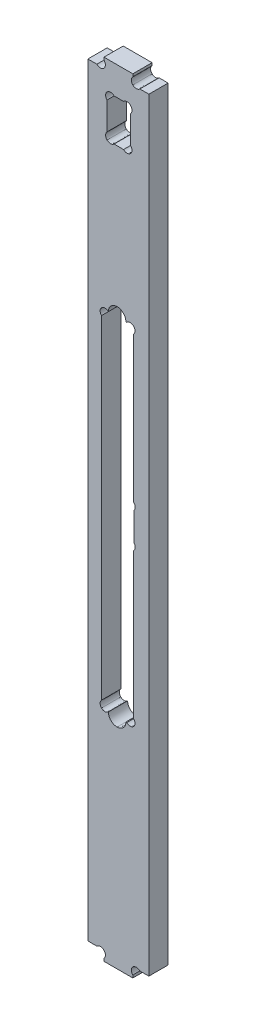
ISO-10303-21;
HEADER;
FILE_DESCRIPTION(('STEP AP214'),'2;1');
FILE_NAME('part.step','',(''),(''),'','','');
FILE_SCHEMA(('AUTOMOTIVE_DESIGN { 1 0 10303 214 1 1 1 1 }'));
ENDSEC;
DATA;
#1=APPLICATION_CONTEXT('core data for automotive mechanical design processes');
#2=APPLICATION_PROTOCOL_DEFINITION('international standard','automotive_design',2000,#1);
#3=PRODUCT_CONTEXT('',#1,'mechanical');
#4=PRODUCT('Part','Part','',(#3));
#5=PRODUCT_RELATED_PRODUCT_CATEGORY('part','',(#4));
#6=PRODUCT_DEFINITION_FORMATION('','',#4);
#7=PRODUCT_DEFINITION_CONTEXT('part definition',#1,'design');
#8=PRODUCT_DEFINITION('design','',#6,#7);
#9=PRODUCT_DEFINITION_SHAPE('','',#8);
#10=(LENGTH_UNIT() NAMED_UNIT(*) SI_UNIT(.MILLI.,.METRE.));
#11=(NAMED_UNIT(*) PLANE_ANGLE_UNIT() SI_UNIT($,.RADIAN.));
#12=(NAMED_UNIT(*) SI_UNIT($,.STERADIAN.) SOLID_ANGLE_UNIT());
#13=UNCERTAINTY_MEASURE_WITH_UNIT(LENGTH_MEASURE(1.E-05),#10,'distance_accuracy_value','');
#14=(GEOMETRIC_REPRESENTATION_CONTEXT(3) GLOBAL_UNCERTAINTY_ASSIGNED_CONTEXT((#13)) GLOBAL_UNIT_ASSIGNED_CONTEXT((#10,
#11,#12)) REPRESENTATION_CONTEXT('',''));
#15=CARTESIAN_POINT('',(0.,0.,0.));
#16=DIRECTION('',(0.,0.,1.));
#17=DIRECTION('',(1.,0.,0.));
#18=AXIS2_PLACEMENT_3D('',#15,#16,#17);
#19=CARTESIAN_POINT('',(2381.44054352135,44.7266711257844,6.));
#20=CARTESIAN_POINT('',(2382.04585617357,44.1213584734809,6.));
#21=CARTESIAN_POINT('',(2382.04585617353,43.1399527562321,6.));
#22=CARTESIAN_POINT('',(2381.44054352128,42.5346401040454,6.));
#23=B_SPLINE_CURVE_WITH_KNOTS('',3,(#19,#20,#21,#22),.UNSPECIFIED.,.F.,.F.,(4,4),(9.,10.),.UNSPECIFIED.);
#24=DIRECTION('',(0.,0.,-1.));
#25=VECTOR('',#24,1.);
#26=SURFACE_OF_LINEAR_EXTRUSION('',#23,#25);
#27=CARTESIAN_POINT('',(2381.44054352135,44.7266711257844,0.));
#28=CARTESIAN_POINT('',(2382.04585617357,44.1213584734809,0.));
#29=CARTESIAN_POINT('',(2382.04585617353,43.1399527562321,0.));
#30=CARTESIAN_POINT('',(2381.44054352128,42.5346401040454,0.));
#31=B_SPLINE_CURVE_WITH_KNOTS('',3,(#27,#28,#29,#30),.UNSPECIFIED.,.F.,.F.,(4,4),(9.,10.),.UNSPECIFIED.);
#32=CARTESIAN_POINT('',(2381.44054352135,44.7266711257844,0.));
#33=VERTEX_POINT('',#32);
#34=CARTESIAN_POINT('',(2381.44054352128,42.5346401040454,0.));
#35=VERTEX_POINT('',#34);
#36=EDGE_CURVE('E906',#33,#35,#31,.T.);
#37=ORIENTED_EDGE('',*,*,#36,.T.);
#38=DIRECTION('',(0.,0.,-1.));
#39=VECTOR('',#38,1.);
#40=CARTESIAN_POINT('',(2381.44054352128,42.5346401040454,6.));
#41=LINE('',#40,#39);
#42=CARTESIAN_POINT('',(2381.44054352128,42.5346401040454,6.));
#43=VERTEX_POINT('',#42);
#44=EDGE_CURVE('E11',#43,#35,#41,.T.);
#45=ORIENTED_EDGE('',*,*,#44,.F.);
#46=CARTESIAN_POINT('',(2381.44054352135,44.7266711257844,6.));
#47=VERTEX_POINT('',#46);
#48=EDGE_CURVE('E505',#47,#43,#23,.T.);
#49=ORIENTED_EDGE('',*,*,#48,.F.);
#50=DIRECTION('',(0.,0.,-1.));
#51=VECTOR('',#50,1.);
#52=CARTESIAN_POINT('',(2381.44054352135,44.7266711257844,6.));
#53=LINE('',#52,#51);
#54=EDGE_CURVE('E601',#47,#33,#53,.T.);
#55=ORIENTED_EDGE('',*,*,#54,.T.);
#56=EDGE_LOOP('',(#37,#45,#49,#55));
#57=FACE_BOUND('',#56,.T.);
#58=ADVANCED_FACE('F36',(#57),#26,.F.);
#59=CARTESIAN_POINT('',(2381.44054352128,42.5346401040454,6.));
#60=CARTESIAN_POINT('',(2380.83523086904,41.9293274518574,6.));
#61=CARTESIAN_POINT('',(2379.85382515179,41.9293274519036,6.));
#62=CARTESIAN_POINT('',(2379.24851249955,42.5346401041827,6.));
#63=B_SPLINE_CURVE_WITH_KNOTS('',3,(#59,#60,#61,#62),.UNSPECIFIED.,.F.,.F.,(4,4),(10.,11.),.UNSPECIFIED.);
#64=DIRECTION('',(0.,0.,-1.));
#65=VECTOR('',#64,1.);
#66=SURFACE_OF_LINEAR_EXTRUSION('',#63,#65);
#67=CARTESIAN_POINT('',(2381.44054352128,42.5346401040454,0.));
#68=CARTESIAN_POINT('',(2380.83523086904,41.9293274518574,0.));
#69=CARTESIAN_POINT('',(2379.85382515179,41.9293274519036,0.));
#70=CARTESIAN_POINT('',(2379.24851249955,42.5346401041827,0.));
#71=B_SPLINE_CURVE_WITH_KNOTS('',3,(#67,#68,#69,#70),.UNSPECIFIED.,.F.,.F.,(4,4),(10.,11.),.UNSPECIFIED.);
#72=CARTESIAN_POINT('',(2379.24851249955,42.5346401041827,0.));
#73=VERTEX_POINT('',#72);
#74=EDGE_CURVE('E911',#35,#73,#71,.T.);
#75=ORIENTED_EDGE('',*,*,#74,.T.);
#76=DIRECTION('',(0.,0.,-1.));
#77=VECTOR('',#76,1.);
#78=CARTESIAN_POINT('',(2379.24851249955,42.5346401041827,6.));
#79=LINE('',#78,#77);
#80=CARTESIAN_POINT('',(2379.24851249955,42.5346401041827,6.));
#81=VERTEX_POINT('',#80);
#82=EDGE_CURVE('E47',#81,#73,#79,.T.);
#83=ORIENTED_EDGE('',*,*,#82,.F.);
#84=EDGE_CURVE('E500',#43,#81,#63,.T.);
#85=ORIENTED_EDGE('',*,*,#84,.F.);
#86=ORIENTED_EDGE('',*,*,#44,.T.);
#87=EDGE_LOOP('',(#75,#83,#85,#86));
#88=FACE_BOUND('',#87,.T.);
#89=ADVANCED_FACE('F492',(#88),#66,.F.);
#90=CARTESIAN_POINT('',(0.,42.5346401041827,6.));
#91=DIRECTION('',(0.,-1.,0.));
#92=DIRECTION('',(0.,0.,-1.));
#93=AXIS2_PLACEMENT_3D('',#90,#91,#92);
#94=PLANE('',#93);
#95=DIRECTION('',(-1.,0.,0.));
#96=VECTOR('',#95,1.);
#97=CARTESIAN_POINT('',(0.,42.5346401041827,0.));
#98=LINE('',#97,#96);
#99=CARTESIAN_POINT('',(2376.30068631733,42.5346401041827,0.));
#100=VERTEX_POINT('',#99);
#101=EDGE_CURVE('E918',#73,#100,#98,.T.);
#102=ORIENTED_EDGE('',*,*,#101,.T.);
#103=DIRECTION('',(0.,0.,-1.));
#104=VECTOR('',#103,1.);
#105=CARTESIAN_POINT('',(2376.30068631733,42.5346401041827,6.));
#106=LINE('',#105,#104);
#107=CARTESIAN_POINT('',(2376.30068631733,42.5346401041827,6.));
#108=VERTEX_POINT('',#107);
#109=EDGE_CURVE('E525',#108,#100,#106,.T.);
#110=ORIENTED_EDGE('',*,*,#109,.F.);
#111=DIRECTION('',(-1.,0.,0.));
#112=VECTOR('',#111,1.);
#113=CARTESIAN_POINT('',(0.,42.5346401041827,6.));
#114=LINE('',#113,#112);
#115=EDGE_CURVE('E504',#81,#108,#114,.T.);
#116=ORIENTED_EDGE('',*,*,#115,.F.);
#117=ORIENTED_EDGE('',*,*,#82,.T.);
#118=EDGE_LOOP('',(#102,#110,#116,#117));
#119=FACE_BOUND('',#118,.T.);
#120=ADVANCED_FACE('F488',(#119),#94,.F.);
#121=CARTESIAN_POINT('',(2376.30068631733,42.5346401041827,6.));
#122=CARTESIAN_POINT('',(2375.69537366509,41.9293274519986,6.));
#123=CARTESIAN_POINT('',(2374.71396794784,41.9293274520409,6.));
#124=CARTESIAN_POINT('',(2374.10865529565,42.5346401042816,6.));
#125=B_SPLINE_CURVE_WITH_KNOTS('',3,(#121,#122,#123,#124),.UNSPECIFIED.,.F.,.F.,(4,4),(0.,1.),.UNSPECIFIED.);
#126=DIRECTION('',(0.,0.,-1.));
#127=VECTOR('',#126,1.);
#128=SURFACE_OF_LINEAR_EXTRUSION('',#125,#127);
#129=CARTESIAN_POINT('',(2376.30068631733,42.5346401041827,0.));
#130=CARTESIAN_POINT('',(2375.69537366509,41.9293274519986,0.));
#131=CARTESIAN_POINT('',(2374.71396794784,41.9293274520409,0.));
#132=CARTESIAN_POINT('',(2374.10865529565,42.5346401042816,0.));
#133=B_SPLINE_CURVE_WITH_KNOTS('',3,(#129,#130,#131,#132),.UNSPECIFIED.,.F.,.F.,(4,4),(0.,1.),.UNSPECIFIED.);
#134=CARTESIAN_POINT('',(2374.10865529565,42.5346401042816,0.));
#135=VERTEX_POINT('',#134);
#136=EDGE_CURVE('E523',#100,#135,#133,.T.);
#137=ORIENTED_EDGE('',*,*,#136,.T.);
#138=DIRECTION('',(0.,0.,-1.));
#139=VECTOR('',#138,1.);
#140=CARTESIAN_POINT('',(2374.10865529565,42.5346401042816,6.));
#141=LINE('',#140,#139);
#142=CARTESIAN_POINT('',(2374.10865529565,42.5346401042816,6.));
#143=VERTEX_POINT('',#142);
#144=EDGE_CURVE('E521',#143,#135,#141,.T.);
#145=ORIENTED_EDGE('',*,*,#144,.F.);
#146=EDGE_CURVE('E471',#108,#143,#125,.T.);
#147=ORIENTED_EDGE('',*,*,#146,.F.);
#148=ORIENTED_EDGE('',*,*,#109,.T.);
#149=EDGE_LOOP('',(#137,#145,#147,#148));
#150=FACE_BOUND('',#149,.T.);
#151=ADVANCED_FACE('F484',(#150),#128,.F.);
#152=CARTESIAN_POINT('',(2374.10865529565,42.5346401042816,6.));
#153=CARTESIAN_POINT('',(2373.50334264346,43.139952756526,6.));
#154=CARTESIAN_POINT('',(2373.50334264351,44.1213584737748,6.));
#155=CARTESIAN_POINT('',(2374.10865529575,44.7266711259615,6.));
#156=B_SPLINE_CURVE_WITH_KNOTS('',3,(#152,#153,#154,#155),.UNSPECIFIED.,.F.,.F.,(4,4),(1.,2.),.UNSPECIFIED.);
#157=DIRECTION('',(0.,0.,-1.));
#158=VECTOR('',#157,1.);
#159=SURFACE_OF_LINEAR_EXTRUSION('',#156,#158);
#160=CARTESIAN_POINT('',(2374.10865529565,42.5346401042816,0.));
#161=CARTESIAN_POINT('',(2373.50334264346,43.139952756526,0.));
#162=CARTESIAN_POINT('',(2373.50334264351,44.1213584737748,0.));
#163=CARTESIAN_POINT('',(2374.10865529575,44.7266711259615,0.));
#164=B_SPLINE_CURVE_WITH_KNOTS('',3,(#160,#161,#162,#163),.UNSPECIFIED.,.F.,.F.,(4,4),(1.,2.),.UNSPECIFIED.);
#165=CARTESIAN_POINT('',(2374.10865529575,44.7266711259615,0.));
#166=VERTEX_POINT('',#165);
#167=EDGE_CURVE('E530',#135,#166,#164,.T.);
#168=ORIENTED_EDGE('',*,*,#167,.T.);
#169=DIRECTION('',(0.,0.,-1.));
#170=VECTOR('',#169,1.);
#171=CARTESIAN_POINT('',(2374.10865529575,44.7266711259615,6.));
#172=LINE('',#171,#170);
#173=CARTESIAN_POINT('',(2374.10865529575,44.7266711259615,6.));
#174=VERTEX_POINT('',#173);
#175=EDGE_CURVE('E526',#174,#166,#172,.T.);
#176=ORIENTED_EDGE('',*,*,#175,.F.);
#177=EDGE_CURVE('E466',#143,#174,#156,.T.);
#178=ORIENTED_EDGE('',*,*,#177,.F.);
#179=ORIENTED_EDGE('',*,*,#144,.T.);
#180=EDGE_LOOP('',(#168,#176,#178,#179));
#181=FACE_BOUND('',#180,.T.);
#182=ADVANCED_FACE('F480',(#181),#159,.F.);
#183=CARTESIAN_POINT('',(2374.10865529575,0.,6.));
#184=DIRECTION('',(-1.,0.,0.));
#185=DIRECTION('',(0.,0.,1.));
#186=AXIS2_PLACEMENT_3D('',#183,#184,#185);
#187=PLANE('',#186);
#188=DIRECTION('',(0.,1.,0.));
#189=VECTOR('',#188,1.);
#190=CARTESIAN_POINT('',(2374.10865529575,0.,0.));
#191=LINE('',#190,#189);
#192=CARTESIAN_POINT('',(2374.10865529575,53.3302634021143,0.));
#193=VERTEX_POINT('',#192);
#194=EDGE_CURVE('E932',#166,#193,#191,.T.);
#195=ORIENTED_EDGE('',*,*,#194,.T.);
#196=DIRECTION('',(0.,0.,-1.));
#197=VECTOR('',#196,1.);
#198=CARTESIAN_POINT('',(2374.10865529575,53.3302634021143,6.));
#199=LINE('',#198,#197);
#200=CARTESIAN_POINT('',(2374.10865529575,53.3302634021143,6.));
#201=VERTEX_POINT('',#200);
#202=EDGE_CURVE('E533',#201,#193,#199,.T.);
#203=ORIENTED_EDGE('',*,*,#202,.F.);
#204=DIRECTION('',(0.,1.,0.));
#205=VECTOR('',#204,1.);
#206=CARTESIAN_POINT('',(2374.10865529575,0.,6.));
#207=LINE('',#206,#205);
#208=EDGE_CURVE('E461',#174,#201,#207,.T.);
#209=ORIENTED_EDGE('',*,*,#208,.F.);
#210=ORIENTED_EDGE('',*,*,#175,.T.);
#211=EDGE_LOOP('',(#195,#203,#209,#210));
#212=FACE_BOUND('',#211,.T.);
#213=ADVANCED_FACE('F483',(#212),#187,.F.);
#214=CARTESIAN_POINT('',(2374.10865529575,53.3302634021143,6.));
#215=CARTESIAN_POINT('',(2373.50334264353,53.935576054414,6.));
#216=CARTESIAN_POINT('',(2373.50334264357,54.9169817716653,6.));
#217=CARTESIAN_POINT('',(2374.10865529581,55.5222944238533,6.));
#218=B_SPLINE_CURVE_WITH_KNOTS('',3,(#214,#215,#216,#217),.UNSPECIFIED.,.F.,.F.,(4,4),(3.,4.),.UNSPECIFIED.);
#219=DIRECTION('',(0.,0.,-1.));
#220=VECTOR('',#219,1.);
#221=SURFACE_OF_LINEAR_EXTRUSION('',#218,#220);
#222=CARTESIAN_POINT('',(2374.10865529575,53.3302634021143,0.));
#223=CARTESIAN_POINT('',(2373.50334264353,53.935576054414,0.));
#224=CARTESIAN_POINT('',(2373.50334264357,54.9169817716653,0.));
#225=CARTESIAN_POINT('',(2374.10865529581,55.5222944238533,0.));
#226=B_SPLINE_CURVE_WITH_KNOTS('',3,(#222,#223,#224,#225),.UNSPECIFIED.,.F.,.F.,(4,4),(3.,4.),.UNSPECIFIED.);
#227=CARTESIAN_POINT('',(2374.10865529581,55.5222944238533,0.));
#228=VERTEX_POINT('',#227);
#229=EDGE_CURVE('E545',#193,#228,#226,.T.);
#230=ORIENTED_EDGE('',*,*,#229,.T.);
#231=DIRECTION('',(0.,0.,-1.));
#232=VECTOR('',#231,1.);
#233=CARTESIAN_POINT('',(2374.10865529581,55.5222944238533,6.));
#234=LINE('',#233,#232);
#235=CARTESIAN_POINT('',(2374.10865529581,55.5222944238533,6.));
#236=VERTEX_POINT('',#235);
#237=EDGE_CURVE('E543',#236,#228,#234,.T.);
#238=ORIENTED_EDGE('',*,*,#237,.F.);
#239=EDGE_CURVE('E453',#201,#236,#218,.T.);
#240=ORIENTED_EDGE('',*,*,#239,.F.);
#241=ORIENTED_EDGE('',*,*,#202,.T.);
#242=EDGE_LOOP('',(#230,#238,#240,#241));
#243=FACE_BOUND('',#242,.T.);
#244=ADVANCED_FACE('F445',(#243),#221,.F.);
#245=CARTESIAN_POINT('',(2374.10865529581,55.5222944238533,6.));
#246=CARTESIAN_POINT('',(2374.71396794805,56.1276070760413,6.));
#247=CARTESIAN_POINT('',(2375.6953736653,56.1276070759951,6.));
#248=CARTESIAN_POINT('',(2376.30068631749,55.5222944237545,6.));
#249=B_SPLINE_CURVE_WITH_KNOTS('',3,(#245,#246,#247,#248),.UNSPECIFIED.,.F.,.F.,(4,4),(4.,5.),.UNSPECIFIED.);
#250=DIRECTION('',(0.,0.,-1.));
#251=VECTOR('',#250,1.);
#252=SURFACE_OF_LINEAR_EXTRUSION('',#249,#251);
#253=CARTESIAN_POINT('',(2374.10865529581,55.5222944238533,0.));
#254=CARTESIAN_POINT('',(2374.71396794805,56.1276070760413,0.));
#255=CARTESIAN_POINT('',(2375.6953736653,56.1276070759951,0.));
#256=CARTESIAN_POINT('',(2376.30068631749,55.5222944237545,0.));
#257=B_SPLINE_CURVE_WITH_KNOTS('',3,(#253,#254,#255,#256),.UNSPECIFIED.,.F.,.F.,(4,4),(4.,5.),.UNSPECIFIED.);
#258=CARTESIAN_POINT('',(2376.30068631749,55.5222944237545,0.));
#259=VERTEX_POINT('',#258);
#260=EDGE_CURVE('E550',#228,#259,#257,.T.);
#261=ORIENTED_EDGE('',*,*,#260,.T.);
#262=DIRECTION('',(0.,0.,-1.));
#263=VECTOR('',#262,1.);
#264=CARTESIAN_POINT('',(2376.30068631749,55.5222944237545,6.));
#265=LINE('',#264,#263);
#266=CARTESIAN_POINT('',(2376.30068631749,55.5222944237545,6.));
#267=VERTEX_POINT('',#266);
#268=EDGE_CURVE('E547',#267,#259,#265,.T.);
#269=ORIENTED_EDGE('',*,*,#268,.F.);
#270=EDGE_CURVE('E449',#236,#267,#249,.T.);
#271=ORIENTED_EDGE('',*,*,#270,.F.);
#272=ORIENTED_EDGE('',*,*,#237,.T.);
#273=EDGE_LOOP('',(#261,#269,#271,#272));
#274=FACE_BOUND('',#273,.T.);
#275=ADVANCED_FACE('F440',(#274),#252,.F.);
#276=CARTESIAN_POINT('',(0.,55.5222944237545,6.));
#277=DIRECTION('',(0.,1.,0.));
#278=DIRECTION('',(0.,0.,1.));
#279=AXIS2_PLACEMENT_3D('',#276,#277,#278);
#280=PLANE('',#279);
#281=DIRECTION('',(1.,0.,0.));
#282=VECTOR('',#281,1.);
#283=CARTESIAN_POINT('',(0.,55.5222944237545,0.));
#284=LINE('',#283,#282);
#285=CARTESIAN_POINT('',(2379.2485124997,55.5222944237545,0.));
#286=VERTEX_POINT('',#285);
#287=EDGE_CURVE('E553',#259,#286,#284,.T.);
#288=ORIENTED_EDGE('',*,*,#287,.T.);
#289=DIRECTION('',(0.,0.,-1.));
#290=VECTOR('',#289,1.);
#291=CARTESIAN_POINT('',(2379.2485124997,55.5222944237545,6.));
#292=LINE('',#291,#290);
#293=CARTESIAN_POINT('',(2379.2485124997,55.5222944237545,6.));
#294=VERTEX_POINT('',#293);
#295=EDGE_CURVE('E410',#294,#286,#292,.T.);
#296=ORIENTED_EDGE('',*,*,#295,.F.);
#297=DIRECTION('',(1.,0.,0.));
#298=VECTOR('',#297,1.);
#299=CARTESIAN_POINT('',(0.,55.5222944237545,6.));
#300=LINE('',#299,#298);
#301=EDGE_CURVE('E401',#267,#294,#300,.T.);
#302=ORIENTED_EDGE('',*,*,#301,.F.);
#303=ORIENTED_EDGE('',*,*,#268,.T.);
#304=EDGE_LOOP('',(#288,#296,#302,#303));
#305=FACE_BOUND('',#304,.T.);
#306=ADVANCED_FACE('F437',(#305),#280,.F.);
#307=CARTESIAN_POINT('',(2379.2485124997,55.5222944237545,6.));
#308=CARTESIAN_POINT('',(2379.85382515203,56.1276070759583,6.));
#309=CARTESIAN_POINT('',(2380.83523086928,56.1276070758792,6.));
#310=CARTESIAN_POINT('',(2381.44054352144,55.5222944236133,6.));
#311=B_SPLINE_CURVE_WITH_KNOTS('',3,(#307,#308,#309,#310),.UNSPECIFIED.,.F.,.F.,(4,4),(6.,7.),.UNSPECIFIED.);
#312=DIRECTION('',(0.,0.,-1.));
#313=VECTOR('',#312,1.);
#314=SURFACE_OF_LINEAR_EXTRUSION('',#311,#313);
#315=CARTESIAN_POINT('',(2379.2485124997,55.5222944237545,0.));
#316=CARTESIAN_POINT('',(2379.85382515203,56.1276070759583,0.));
#317=CARTESIAN_POINT('',(2380.83523086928,56.1276070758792,0.));
#318=CARTESIAN_POINT('',(2381.44054352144,55.5222944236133,0.));
#319=B_SPLINE_CURVE_WITH_KNOTS('',3,(#315,#316,#317,#318),.UNSPECIFIED.,.F.,.F.,(4,4),(6.,7.),.UNSPECIFIED.);
#320=CARTESIAN_POINT('',(2381.44054352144,55.5222944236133,0.));
#321=VERTEX_POINT('',#320);
#322=EDGE_CURVE('E409',#286,#321,#319,.T.);
#323=ORIENTED_EDGE('',*,*,#322,.T.);
#324=DIRECTION('',(0.,0.,-1.));
#325=VECTOR('',#324,1.);
#326=CARTESIAN_POINT('',(2381.44054352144,55.5222944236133,6.));
#327=LINE('',#326,#325);
#328=CARTESIAN_POINT('',(2381.44054352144,55.5222944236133,6.));
#329=VERTEX_POINT('',#328);
#330=EDGE_CURVE('E406',#329,#321,#327,.T.);
#331=ORIENTED_EDGE('',*,*,#330,.F.);
#332=EDGE_CURVE('E395',#294,#329,#311,.T.);
#333=ORIENTED_EDGE('',*,*,#332,.F.);
#334=ORIENTED_EDGE('',*,*,#295,.T.);
#335=EDGE_LOOP('',(#323,#331,#333,#334));
#336=FACE_BOUND('',#335,.T.);
#337=ADVANCED_FACE('F407',(#336),#314,.F.);
#338=CARTESIAN_POINT('',(2381.44054352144,55.5222944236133,6.));
#339=CARTESIAN_POINT('',(2382.04585617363,54.9169817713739,6.));
#340=CARTESIAN_POINT('',(2382.04585617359,53.9355760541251,6.));
#341=CARTESIAN_POINT('',(2381.44054352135,53.3302634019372,6.));
#342=B_SPLINE_CURVE_WITH_KNOTS('',3,(#338,#339,#340,#341),.UNSPECIFIED.,.F.,.F.,(4,4),(7.,8.),.UNSPECIFIED.);
#343=DIRECTION('',(0.,0.,-1.));
#344=VECTOR('',#343,1.);
#345=SURFACE_OF_LINEAR_EXTRUSION('',#342,#344);
#346=CARTESIAN_POINT('',(2381.44054352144,55.5222944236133,0.));
#347=CARTESIAN_POINT('',(2382.04585617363,54.9169817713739,0.));
#348=CARTESIAN_POINT('',(2382.04585617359,53.9355760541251,0.));
#349=CARTESIAN_POINT('',(2381.44054352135,53.3302634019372,0.));
#350=B_SPLINE_CURVE_WITH_KNOTS('',3,(#346,#347,#348,#349),.UNSPECIFIED.,.F.,.F.,(4,4),(7.,8.),.UNSPECIFIED.);
#351=CARTESIAN_POINT('',(2381.44054352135,53.3302634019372,0.));
#352=VERTEX_POINT('',#351);
#353=EDGE_CURVE('E226',#321,#352,#350,.T.);
#354=ORIENTED_EDGE('',*,*,#353,.T.);
#355=DIRECTION('',(0.,0.,-1.));
#356=VECTOR('',#355,1.);
#357=CARTESIAN_POINT('',(2381.44054352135,53.3302634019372,6.));
#358=LINE('',#357,#356);
#359=CARTESIAN_POINT('',(2381.44054352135,53.3302634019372,6.));
#360=VERTEX_POINT('',#359);
#361=EDGE_CURVE('E411',#360,#352,#358,.T.);
#362=ORIENTED_EDGE('',*,*,#361,.F.);
#363=EDGE_CURVE('E399',#329,#360,#342,.T.);
#364=ORIENTED_EDGE('',*,*,#363,.F.);
#365=ORIENTED_EDGE('',*,*,#330,.T.);
#366=EDGE_LOOP('',(#354,#362,#364,#365));
#367=FACE_BOUND('',#366,.T.);
#368=ADVANCED_FACE('F413',(#367),#345,.F.);
#369=CARTESIAN_POINT('',(2382.13532883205,-176.588816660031,6.));
#370=CARTESIAN_POINT('',(2381.53001617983,-177.194129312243,6.));
#371=CARTESIAN_POINT('',(2381.53001617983,-178.175535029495,6.));
#372=CARTESIAN_POINT('',(2382.13532883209,-178.780847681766,6.));
#373=B_SPLINE_CURVE_WITH_KNOTS('',3,(#369,#370,#371,#372),.UNSPECIFIED.,.F.,.F.,(4,4),(19.,20.),.UNSPECIFIED.);
#374=DIRECTION('',(0.,0.,-1.));
#375=VECTOR('',#374,1.);
#376=SURFACE_OF_LINEAR_EXTRUSION('',#373,#375);
#377=CARTESIAN_POINT('',(2382.13532883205,-176.588816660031,0.));
#378=CARTESIAN_POINT('',(2381.53001617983,-177.194129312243,0.));
#379=CARTESIAN_POINT('',(2381.53001617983,-178.175535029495,0.));
#380=CARTESIAN_POINT('',(2382.13532883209,-178.780847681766,0.));
#381=B_SPLINE_CURVE_WITH_KNOTS('',3,(#377,#378,#379,#380),.UNSPECIFIED.,.F.,.F.,(4,4),(19.,20.),.UNSPECIFIED.);
#382=CARTESIAN_POINT('',(2382.13532883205,-176.588816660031,0.));
#383=VERTEX_POINT('',#382);
#384=CARTESIAN_POINT('',(2382.13532883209,-178.780847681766,0.));
#385=VERTEX_POINT('',#384);
#386=EDGE_CURVE('E803',#383,#385,#381,.T.);
#387=ORIENTED_EDGE('',*,*,#386,.F.);
#388=DIRECTION('',(0.,0.,-1.));
#389=VECTOR('',#388,1.);
#390=CARTESIAN_POINT('',(2382.13532883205,-176.588816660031,6.));
#391=LINE('',#390,#389);
#392=CARTESIAN_POINT('',(2382.13532883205,-176.588816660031,6.));
#393=VERTEX_POINT('',#392);
#394=EDGE_CURVE('E599',#393,#383,#391,.T.);
#395=ORIENTED_EDGE('',*,*,#394,.F.);
#396=CARTESIAN_POINT('',(2382.13532883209,-178.780847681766,6.));
#397=VERTEX_POINT('',#396);
#398=EDGE_CURVE('E1071',#393,#397,#373,.T.);
#399=ORIENTED_EDGE('',*,*,#398,.T.);
#400=DIRECTION('',(0.,0.,-1.));
#401=VECTOR('',#400,1.);
#402=CARTESIAN_POINT('',(2382.13532883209,-178.780847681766,6.));
#403=LINE('',#402,#401);
#404=EDGE_CURVE('E561',#397,#385,#403,.T.);
#405=ORIENTED_EDGE('',*,*,#404,.T.);
#406=EDGE_LOOP('',(#387,#395,#399,#405));
#407=FACE_BOUND('',#406,.T.);
#408=ADVANCED_FACE('F432',(#407),#376,.T.);
#409=CARTESIAN_POINT('',(2384.32735985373,-176.588816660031,6.));
#410=CARTESIAN_POINT('',(2383.72204720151,-175.983504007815,6.));
#411=CARTESIAN_POINT('',(2382.74064148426,-175.983504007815,6.));
#412=CARTESIAN_POINT('',(2382.13532883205,-176.588816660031,6.));
#413=B_SPLINE_CURVE_WITH_KNOTS('',3,(#409,#410,#411,#412),.UNSPECIFIED.,.F.,.F.,(4,4),(18.,19.),.UNSPECIFIED.);
#414=DIRECTION('',(0.,0.,-1.));
#415=VECTOR('',#414,1.);
#416=SURFACE_OF_LINEAR_EXTRUSION('',#413,#415);
#417=CARTESIAN_POINT('',(2384.32735985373,-176.588816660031,0.));
#418=CARTESIAN_POINT('',(2383.72204720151,-175.983504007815,0.));
#419=CARTESIAN_POINT('',(2382.74064148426,-175.983504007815,0.));
#420=CARTESIAN_POINT('',(2382.13532883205,-176.588816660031,0.));
#421=B_SPLINE_CURVE_WITH_KNOTS('',3,(#417,#418,#419,#420),.UNSPECIFIED.,.F.,.F.,(4,4),(18.,19.),.UNSPECIFIED.);
#422=CARTESIAN_POINT('',(2384.32735985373,-176.588816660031,0.));
#423=VERTEX_POINT('',#422);
#424=EDGE_CURVE('E811',#423,#383,#421,.T.);
#425=ORIENTED_EDGE('',*,*,#424,.F.);
#426=DIRECTION('',(0.,0.,-1.));
#427=VECTOR('',#426,1.);
#428=CARTESIAN_POINT('',(2384.32735985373,-176.588816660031,6.));
#429=LINE('',#428,#427);
#430=CARTESIAN_POINT('',(2384.32735985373,-176.588816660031,6.));
#431=VERTEX_POINT('',#430);
#432=EDGE_CURVE('E597',#431,#423,#429,.T.);
#433=ORIENTED_EDGE('',*,*,#432,.F.);
#434=EDGE_CURVE('E1074',#431,#393,#413,.T.);
#435=ORIENTED_EDGE('',*,*,#434,.T.);
#436=ORIENTED_EDGE('',*,*,#394,.T.);
#437=EDGE_LOOP('',(#425,#433,#435,#436));
#438=FACE_BOUND('',#437,.T.);
#439=ADVANCED_FACE('F1102',(#438),#416,.T.);
#440=CARTESIAN_POINT('',(0.,-176.588816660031,6.));
#441=DIRECTION('',(0.,-1.,0.));
#442=DIRECTION('',(0.,0.,-1.));
#443=AXIS2_PLACEMENT_3D('',#440,#441,#442);
#444=PLANE('',#443);
#445=DIRECTION('',(-1.,0.,0.));
#446=VECTOR('',#445,1.);
#447=CARTESIAN_POINT('',(0.,-176.588816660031,0.));
#448=LINE('',#447,#446);
#449=CARTESIAN_POINT('',(2387.13532883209,-176.588816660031,0.));
#450=VERTEX_POINT('',#449);
#451=EDGE_CURVE('E819',#450,#423,#448,.T.);
#452=ORIENTED_EDGE('',*,*,#451,.F.);
#453=DIRECTION('',(0.,0.,-1.));
#454=VECTOR('',#453,1.);
#455=CARTESIAN_POINT('',(2387.13532883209,-176.588816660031,6.));
#456=LINE('',#455,#454);
#457=CARTESIAN_POINT('',(2387.13532883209,-176.588816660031,6.));
#458=VERTEX_POINT('',#457);
#459=EDGE_CURVE('E595',#458,#450,#456,.T.);
#460=ORIENTED_EDGE('',*,*,#459,.F.);
#461=DIRECTION('',(-1.,0.,0.));
#462=VECTOR('',#461,1.);
#463=CARTESIAN_POINT('',(0.,-176.588816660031,6.));
#464=LINE('',#463,#462);
#465=EDGE_CURVE('E1077',#458,#431,#464,.T.);
#466=ORIENTED_EDGE('',*,*,#465,.T.);
#467=ORIENTED_EDGE('',*,*,#432,.T.);
#468=EDGE_LOOP('',(#452,#460,#466,#467));
#469=FACE_BOUND('',#468,.T.);
#470=ADVANCED_FACE('F1394',(#469),#444,.T.);
#471=CARTESIAN_POINT('',(2387.13532883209,0.,6.));
#472=DIRECTION('',(1.,0.,0.));
#473=DIRECTION('',(0.,0.,-1.));
#474=AXIS2_PLACEMENT_3D('',#471,#472,#473);
#475=PLANE('',#474);
#476=DIRECTION('',(0.,-1.,0.));
#477=VECTOR('',#476,1.);
#478=CARTESIAN_POINT('',(2387.13532883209,0.,0.));
#479=LINE('',#478,#477);
#480=CARTESIAN_POINT('',(2387.13532883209,61.4111833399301,0.));
#481=VERTEX_POINT('',#480);
#482=EDGE_CURVE('E825',#481,#450,#479,.T.);
#483=ORIENTED_EDGE('',*,*,#482,.F.);
#484=DIRECTION('',(0.,0.,-1.));
#485=VECTOR('',#484,1.);
#486=CARTESIAN_POINT('',(2387.13532883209,61.4111833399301,6.));
#487=LINE('',#486,#485);
#488=CARTESIAN_POINT('',(2387.13532883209,61.4111833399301,6.));
#489=VERTEX_POINT('',#488);
#490=EDGE_CURVE('E593',#489,#481,#487,.T.);
#491=ORIENTED_EDGE('',*,*,#490,.F.);
#492=DIRECTION('',(0.,-1.,0.));
#493=VECTOR('',#492,1.);
#494=CARTESIAN_POINT('',(2387.13532883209,0.,6.));
#495=LINE('',#494,#493);
#496=EDGE_CURVE('E1791',#489,#458,#495,.T.);
#497=ORIENTED_EDGE('',*,*,#496,.T.);
#498=ORIENTED_EDGE('',*,*,#459,.T.);
#499=EDGE_LOOP('',(#483,#491,#497,#498));
#500=FACE_BOUND('',#499,.T.);
#501=ADVANCED_FACE('F1402',(#500),#475,.T.);
#502=CARTESIAN_POINT('',(0.,61.4111833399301,6.));
#503=DIRECTION('',(0.,1.,0.));
#504=DIRECTION('',(0.,0.,1.));
#505=AXIS2_PLACEMENT_3D('',#502,#503,#504);
#506=PLANE('',#505);
#507=DIRECTION('',(1.,0.,0.));
#508=VECTOR('',#507,1.);
#509=CARTESIAN_POINT('',(0.,61.4111833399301,0.));
#510=LINE('',#509,#508);
#511=CARTESIAN_POINT('',(2384.32735985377,61.4111833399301,0.));
#512=VERTEX_POINT('',#511);
#513=EDGE_CURVE('E828',#512,#481,#510,.T.);
#514=ORIENTED_EDGE('',*,*,#513,.F.);
#515=DIRECTION('',(0.,0.,-1.));
#516=VECTOR('',#515,1.);
#517=CARTESIAN_POINT('',(2384.32735985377,61.4111833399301,6.));
#518=LINE('',#517,#516);
#519=CARTESIAN_POINT('',(2384.32735985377,61.4111833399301,6.));
#520=VERTEX_POINT('',#519);
#521=EDGE_CURVE('E591',#520,#512,#518,.T.);
#522=ORIENTED_EDGE('',*,*,#521,.F.);
#523=DIRECTION('',(1.,0.,0.));
#524=VECTOR('',#523,1.);
#525=CARTESIAN_POINT('',(0.,61.4111833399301,6.));
#526=LINE('',#525,#524);
#527=EDGE_CURVE('E1785',#520,#489,#526,.T.);
#528=ORIENTED_EDGE('',*,*,#527,.T.);
#529=ORIENTED_EDGE('',*,*,#490,.T.);
#530=EDGE_LOOP('',(#514,#522,#528,#529));
#531=FACE_BOUND('',#530,.T.);
#532=ADVANCED_FACE('F1410',(#531),#506,.T.);
#533=CARTESIAN_POINT('',(2382.13532883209,61.4111833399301,6.));
#534=CARTESIAN_POINT('',(2382.7406414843,60.8058706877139,6.));
#535=CARTESIAN_POINT('',(2383.72204720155,60.8058706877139,6.));
#536=CARTESIAN_POINT('',(2384.32735985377,61.4111833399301,6.));
#537=B_SPLINE_CURVE_WITH_KNOTS('',3,(#533,#534,#535,#536),.UNSPECIFIED.,.F.,.F.,(4,4),(14.,15.),.UNSPECIFIED.);
#538=DIRECTION('',(0.,0.,-1.));
#539=VECTOR('',#538,1.);
#540=SURFACE_OF_LINEAR_EXTRUSION('',#537,#539);
#541=CARTESIAN_POINT('',(2382.13532883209,61.4111833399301,0.));
#542=CARTESIAN_POINT('',(2382.7406414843,60.8058706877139,0.));
#543=CARTESIAN_POINT('',(2383.72204720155,60.8058706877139,0.));
#544=CARTESIAN_POINT('',(2384.32735985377,61.4111833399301,0.));
#545=B_SPLINE_CURVE_WITH_KNOTS('',3,(#541,#542,#543,#544),.UNSPECIFIED.,.F.,.F.,(4,4),(14.,15.),.UNSPECIFIED.);
#546=CARTESIAN_POINT('',(2382.13532883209,61.4111833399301,0.));
#547=VERTEX_POINT('',#546);
#548=EDGE_CURVE('E831',#547,#512,#545,.T.);
#549=ORIENTED_EDGE('',*,*,#548,.F.);
#550=DIRECTION('',(0.,0.,-1.));
#551=VECTOR('',#550,1.);
#552=CARTESIAN_POINT('',(2382.13532883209,61.4111833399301,6.));
#553=LINE('',#552,#551);
#554=CARTESIAN_POINT('',(2382.13532883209,61.4111833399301,6.));
#555=VERTEX_POINT('',#554);
#556=EDGE_CURVE('E589',#555,#547,#553,.T.);
#557=ORIENTED_EDGE('',*,*,#556,.F.);
#558=EDGE_CURVE('E1776',#555,#520,#537,.T.);
#559=ORIENTED_EDGE('',*,*,#558,.T.);
#560=ORIENTED_EDGE('',*,*,#521,.T.);
#561=EDGE_LOOP('',(#549,#557,#559,#560));
#562=FACE_BOUND('',#561,.T.);
#563=ADVANCED_FACE('F1419',(#562),#540,.T.);
#564=CARTESIAN_POINT('',(2382.13532883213,63.6032143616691,6.));
#565=CARTESIAN_POINT('',(2381.53001617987,62.9979017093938,6.));
#566=CARTESIAN_POINT('',(2381.53001617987,62.0164959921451,6.));
#567=CARTESIAN_POINT('',(2382.13532883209,61.4111833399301,6.));
#568=B_SPLINE_CURVE_WITH_KNOTS('',3,(#564,#565,#566,#567),.UNSPECIFIED.,.F.,.F.,(4,4),(13.,14.),.UNSPECIFIED.);
#569=DIRECTION('',(0.,0.,-1.));
#570=VECTOR('',#569,1.);
#571=SURFACE_OF_LINEAR_EXTRUSION('',#568,#570);
#572=CARTESIAN_POINT('',(2382.13532883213,63.6032143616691,0.));
#573=CARTESIAN_POINT('',(2381.53001617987,62.9979017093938,0.));
#574=CARTESIAN_POINT('',(2381.53001617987,62.0164959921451,0.));
#575=CARTESIAN_POINT('',(2382.13532883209,61.4111833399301,0.));
#576=B_SPLINE_CURVE_WITH_KNOTS('',3,(#572,#573,#574,#575),.UNSPECIFIED.,.F.,.F.,(4,4),(13.,14.),.UNSPECIFIED.);
#577=CARTESIAN_POINT('',(2382.13532883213,63.6032143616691,0.));
#578=VERTEX_POINT('',#577);
#579=EDGE_CURVE('E836',#578,#547,#576,.T.);
#580=ORIENTED_EDGE('',*,*,#579,.F.);
#581=DIRECTION('',(0.,0.,-1.));
#582=VECTOR('',#581,1.);
#583=CARTESIAN_POINT('',(2382.13532883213,63.6032143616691,6.));
#584=LINE('',#583,#582);
#585=CARTESIAN_POINT('',(2382.13532883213,63.6032143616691,6.));
#586=VERTEX_POINT('',#585);
#587=EDGE_CURVE('E587',#586,#578,#584,.T.);
#588=ORIENTED_EDGE('',*,*,#587,.F.);
#589=EDGE_CURVE('E1770',#586,#555,#568,.T.);
#590=ORIENTED_EDGE('',*,*,#589,.T.);
#591=ORIENTED_EDGE('',*,*,#556,.T.);
#592=EDGE_LOOP('',(#580,#588,#590,#591));
#593=FACE_BOUND('',#592,.T.);
#594=ADVANCED_FACE('F1428',(#593),#571,.T.);
#595=CARTESIAN_POINT('',(2382.13532883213,0.,6.));
#596=DIRECTION('',(1.,0.,0.));
#597=DIRECTION('',(0.,0.,-1.));
#598=AXIS2_PLACEMENT_3D('',#595,#596,#597);
#599=PLANE('',#598);
#600=DIRECTION('',(0.,-1.,0.));
#601=VECTOR('',#600,1.);
#602=CARTESIAN_POINT('',(2382.13532883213,0.,0.));
#603=LINE('',#602,#601);
#604=CARTESIAN_POINT('',(2382.13532883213,64.4111833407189,0.));
#605=VERTEX_POINT('',#604);
#606=EDGE_CURVE('E844',#605,#578,#603,.T.);
#607=ORIENTED_EDGE('',*,*,#606,.F.);
#608=DIRECTION('',(0.,0.,-1.));
#609=VECTOR('',#608,1.);
#610=CARTESIAN_POINT('',(2382.13532883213,64.4111833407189,6.));
#611=LINE('',#610,#609);
#612=CARTESIAN_POINT('',(2382.13532883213,64.4111833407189,6.));
#613=VERTEX_POINT('',#612);
#614=EDGE_CURVE('E585',#613,#605,#611,.T.);
#615=ORIENTED_EDGE('',*,*,#614,.F.);
#616=DIRECTION('',(0.,-1.,0.));
#617=VECTOR('',#616,1.);
#618=CARTESIAN_POINT('',(2382.13532883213,0.,6.));
#619=LINE('',#618,#617);
#620=EDGE_CURVE('E1765',#613,#586,#619,.T.);
#621=ORIENTED_EDGE('',*,*,#620,.T.);
#622=ORIENTED_EDGE('',*,*,#587,.T.);
#623=EDGE_LOOP('',(#607,#615,#621,#622));
#624=FACE_BOUND('',#623,.T.);
#625=ADVANCED_FACE('F1437',(#624),#599,.T.);
#626=CARTESIAN_POINT('',(0.,64.4111833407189,6.));
#627=DIRECTION('',(0.,1.,0.));
#628=DIRECTION('',(0.,0.,1.));
#629=AXIS2_PLACEMENT_3D('',#626,#627,#628);
#630=PLANE('',#629);
#631=DIRECTION('',(1.,0.,0.));
#632=VECTOR('',#631,1.);
#633=CARTESIAN_POINT('',(0.,64.4111833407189,0.));
#634=LINE('',#633,#632);
#635=CARTESIAN_POINT('',(2373.13532883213,64.4111833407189,0.));
#636=VERTEX_POINT('',#635);
#637=EDGE_CURVE('E850',#636,#605,#634,.T.);
#638=ORIENTED_EDGE('',*,*,#637,.F.);
#639=DIRECTION('',(0.,0.,-1.));
#640=VECTOR('',#639,1.);
#641=CARTESIAN_POINT('',(2373.13532883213,64.4111833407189,6.));
#642=LINE('',#641,#640);
#643=CARTESIAN_POINT('',(2373.13532883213,64.4111833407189,6.));
#644=VERTEX_POINT('',#643);
#645=EDGE_CURVE('E583',#644,#636,#642,.T.);
#646=ORIENTED_EDGE('',*,*,#645,.F.);
#647=DIRECTION('',(1.,0.,0.));
#648=VECTOR('',#647,1.);
#649=CARTESIAN_POINT('',(0.,64.4111833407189,6.));
#650=LINE('',#649,#648);
#651=EDGE_CURVE('E1763',#644,#613,#650,.T.);
#652=ORIENTED_EDGE('',*,*,#651,.T.);
#653=ORIENTED_EDGE('',*,*,#614,.T.);
#654=EDGE_LOOP('',(#638,#646,#652,#653));
#655=FACE_BOUND('',#654,.T.);
#656=ADVANCED_FACE('F1446',(#655),#630,.T.);
#657=CARTESIAN_POINT('',(2373.13532883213,0.,6.));
#658=DIRECTION('',(-1.,0.,0.));
#659=DIRECTION('',(0.,0.,1.));
#660=AXIS2_PLACEMENT_3D('',#657,#658,#659);
#661=PLANE('',#660);
#662=DIRECTION('',(0.,1.,0.));
#663=VECTOR('',#662,1.);
#664=CARTESIAN_POINT('',(2373.13532883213,0.,0.));
#665=LINE('',#664,#663);
#666=CARTESIAN_POINT('',(2373.13532883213,63.60321436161,0.));
#667=VERTEX_POINT('',#666);
#668=EDGE_CURVE('E853',#667,#636,#665,.T.);
#669=ORIENTED_EDGE('',*,*,#668,.F.);
#670=DIRECTION('',(0.,0.,-1.));
#671=VECTOR('',#670,1.);
#672=CARTESIAN_POINT('',(2373.13532883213,63.60321436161,6.));
#673=LINE('',#672,#671);
#674=CARTESIAN_POINT('',(2373.13532883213,63.60321436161,6.));
#675=VERTEX_POINT('',#674);
#676=EDGE_CURVE('E581',#675,#667,#673,.T.);
#677=ORIENTED_EDGE('',*,*,#676,.F.);
#678=DIRECTION('',(0.,1.,0.));
#679=VECTOR('',#678,1.);
#680=CARTESIAN_POINT('',(2373.13532883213,0.,6.));
#681=LINE('',#680,#679);
#682=EDGE_CURVE('E1762',#675,#644,#681,.T.);
#683=ORIENTED_EDGE('',*,*,#682,.T.);
#684=ORIENTED_EDGE('',*,*,#645,.T.);
#685=EDGE_LOOP('',(#669,#677,#683,#684));
#686=FACE_BOUND('',#685,.T.);
#687=ADVANCED_FACE('F1455',(#686),#661,.T.);
#688=CARTESIAN_POINT('',(2373.13532883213,61.4111833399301,6.));
#689=CARTESIAN_POINT('',(2373.74064148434,62.0164959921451,6.));
#690=CARTESIAN_POINT('',(2373.74064148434,62.9979017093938,6.));
#691=CARTESIAN_POINT('',(2373.13532883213,63.60321436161,6.));
#692=B_SPLINE_CURVE_WITH_KNOTS('',3,(#688,#689,#690,#691),.UNSPECIFIED.,.F.,.F.,(4,4),(9.,10.),.UNSPECIFIED.);
#693=DIRECTION('',(0.,0.,-1.));
#694=VECTOR('',#693,1.);
#695=SURFACE_OF_LINEAR_EXTRUSION('',#692,#694);
#696=CARTESIAN_POINT('',(2373.13532883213,61.4111833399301,0.));
#697=CARTESIAN_POINT('',(2373.74064148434,62.0164959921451,0.));
#698=CARTESIAN_POINT('',(2373.74064148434,62.9979017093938,0.));
#699=CARTESIAN_POINT('',(2373.13532883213,63.60321436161,0.));
#700=B_SPLINE_CURVE_WITH_KNOTS('',3,(#696,#697,#698,#699),.UNSPECIFIED.,.F.,.F.,(4,4),(9.,10.),.UNSPECIFIED.);
#701=CARTESIAN_POINT('',(2373.13532883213,61.4111833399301,0.));
#702=VERTEX_POINT('',#701);
#703=EDGE_CURVE('E856',#702,#667,#700,.T.);
#704=ORIENTED_EDGE('',*,*,#703,.F.);
#705=DIRECTION('',(0.,0.,-1.));
#706=VECTOR('',#705,1.);
#707=CARTESIAN_POINT('',(2373.13532883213,61.4111833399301,6.));
#708=LINE('',#707,#706);
#709=CARTESIAN_POINT('',(2373.13532883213,61.4111833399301,6.));
#710=VERTEX_POINT('',#709);
#711=EDGE_CURVE('E579',#710,#702,#708,.T.);
#712=ORIENTED_EDGE('',*,*,#711,.F.);
#713=EDGE_CURVE('E1034',#710,#675,#692,.T.);
#714=ORIENTED_EDGE('',*,*,#713,.T.);
#715=ORIENTED_EDGE('',*,*,#676,.T.);
#716=EDGE_LOOP('',(#704,#712,#714,#715));
#717=FACE_BOUND('',#716,.T.);
#718=ADVANCED_FACE('F1023',(#717),#695,.T.);
#719=CARTESIAN_POINT('',(2370.94329781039,61.4111833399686,6.));
#720=CARTESIAN_POINT('',(2371.54861046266,60.8058706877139,6.));
#721=CARTESIAN_POINT('',(2372.53001617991,60.8058706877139,6.));
#722=CARTESIAN_POINT('',(2373.13532883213,61.4111833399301,6.));
#723=B_SPLINE_CURVE_WITH_KNOTS('',3,(#719,#720,#721,#722),.UNSPECIFIED.,.F.,.F.,(4,4),(8.,9.),.UNSPECIFIED.);
#724=DIRECTION('',(0.,0.,-1.));
#725=VECTOR('',#724,1.);
#726=SURFACE_OF_LINEAR_EXTRUSION('',#723,#725);
#727=CARTESIAN_POINT('',(2370.94329781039,61.4111833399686,0.));
#728=CARTESIAN_POINT('',(2371.54861046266,60.8058706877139,0.));
#729=CARTESIAN_POINT('',(2372.53001617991,60.8058706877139,0.));
#730=CARTESIAN_POINT('',(2373.13532883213,61.4111833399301,0.));
#731=B_SPLINE_CURVE_WITH_KNOTS('',3,(#727,#728,#729,#730),.UNSPECIFIED.,.F.,.F.,(4,4),(8.,9.),.UNSPECIFIED.);
#732=CARTESIAN_POINT('',(2370.94329781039,61.4111833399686,0.));
#733=VERTEX_POINT('',#732);
#734=EDGE_CURVE('E861',#733,#702,#731,.T.);
#735=ORIENTED_EDGE('',*,*,#734,.F.);
#736=DIRECTION('',(0.,0.,-1.));
#737=VECTOR('',#736,1.);
#738=CARTESIAN_POINT('',(2370.94329781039,61.4111833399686,6.));
#739=LINE('',#738,#737);
#740=CARTESIAN_POINT('',(2370.94329781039,61.4111833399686,6.));
#741=VERTEX_POINT('',#740);
#742=EDGE_CURVE('E577',#741,#733,#739,.T.);
#743=ORIENTED_EDGE('',*,*,#742,.F.);
#744=EDGE_CURVE('E1027',#741,#710,#723,.T.);
#745=ORIENTED_EDGE('',*,*,#744,.T.);
#746=ORIENTED_EDGE('',*,*,#711,.T.);
#747=EDGE_LOOP('',(#735,#743,#745,#746));
#748=FACE_BOUND('',#747,.T.);
#749=ADVANCED_FACE('F1018',(#748),#726,.T.);
#750=CARTESIAN_POINT('',(0.,61.4111833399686,6.));
#751=DIRECTION('',(0.,1.,0.));
#752=DIRECTION('',(0.,0.,1.));
#753=AXIS2_PLACEMENT_3D('',#750,#751,#752);
#754=PLANE('',#753);
#755=DIRECTION('',(1.,0.,0.));
#756=VECTOR('',#755,1.);
#757=CARTESIAN_POINT('',(0.,61.4111833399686,0.));
#758=LINE('',#757,#756);
#759=CARTESIAN_POINT('',(2368.13532883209,61.4111833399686,0.));
#760=VERTEX_POINT('',#759);
#761=EDGE_CURVE('E869',#760,#733,#758,.T.);
#762=ORIENTED_EDGE('',*,*,#761,.F.);
#763=DIRECTION('',(0.,0.,-1.));
#764=VECTOR('',#763,1.);
#765=CARTESIAN_POINT('',(2368.13532883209,61.4111833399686,6.));
#766=LINE('',#765,#764);
#767=CARTESIAN_POINT('',(2368.13532883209,61.4111833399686,6.));
#768=VERTEX_POINT('',#767);
#769=EDGE_CURVE('E575',#768,#760,#766,.T.);
#770=ORIENTED_EDGE('',*,*,#769,.F.);
#771=DIRECTION('',(1.,0.,0.));
#772=VECTOR('',#771,1.);
#773=CARTESIAN_POINT('',(0.,61.4111833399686,6.));
#774=LINE('',#773,#772);
#775=EDGE_CURVE('E1033',#768,#741,#774,.T.);
#776=ORIENTED_EDGE('',*,*,#775,.T.);
#777=ORIENTED_EDGE('',*,*,#742,.T.);
#778=EDGE_LOOP('',(#762,#770,#776,#777));
#779=FACE_BOUND('',#778,.T.);
#780=ADVANCED_FACE('F1014',(#779),#754,.T.);
#781=CARTESIAN_POINT('',(2368.13532883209,0.,6.));
#782=DIRECTION('',(-1.,0.,0.));
#783=DIRECTION('',(0.,0.,1.));
#784=AXIS2_PLACEMENT_3D('',#781,#782,#783);
#785=PLANE('',#784);
#786=DIRECTION('',(0.,1.,0.));
#787=VECTOR('',#786,1.);
#788=CARTESIAN_POINT('',(2368.13532883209,0.,0.));
#789=LINE('',#788,#787);
#790=CARTESIAN_POINT('',(2368.13532883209,-176.588816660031,0.));
#791=VERTEX_POINT('',#790);
#792=EDGE_CURVE('E875',#791,#760,#789,.T.);
#793=ORIENTED_EDGE('',*,*,#792,.F.);
#794=DIRECTION('',(0.,0.,-1.));
#795=VECTOR('',#794,1.);
#796=CARTESIAN_POINT('',(2368.13532883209,-176.588816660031,6.));
#797=LINE('',#796,#795);
#798=CARTESIAN_POINT('',(2368.13532883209,-176.588816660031,6.));
#799=VERTEX_POINT('',#798);
#800=EDGE_CURVE('E573',#799,#791,#797,.T.);
#801=ORIENTED_EDGE('',*,*,#800,.F.);
#802=DIRECTION('',(0.,1.,0.));
#803=VECTOR('',#802,1.);
#804=CARTESIAN_POINT('',(2368.13532883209,0.,6.));
#805=LINE('',#804,#803);
#806=EDGE_CURVE('E1044',#799,#768,#805,.T.);
#807=ORIENTED_EDGE('',*,*,#806,.T.);
#808=ORIENTED_EDGE('',*,*,#769,.T.);
#809=EDGE_LOOP('',(#793,#801,#807,#808));
#810=FACE_BOUND('',#809,.T.);
#811=ADVANCED_FACE('F1010',(#810),#785,.T.);
#812=CARTESIAN_POINT('',(0.,-176.588816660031,6.));
#813=DIRECTION('',(0.,-1.,0.));
#814=DIRECTION('',(0.,0.,-1.));
#815=AXIS2_PLACEMENT_3D('',#812,#813,#814);
#816=PLANE('',#815);
#817=DIRECTION('',(-1.,0.,0.));
#818=VECTOR('',#817,1.);
#819=CARTESIAN_POINT('',(0.,-176.588816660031,0.));
#820=LINE('',#819,#818);
#821=CARTESIAN_POINT('',(2370.94329781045,-176.588816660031,0.));
#822=VERTEX_POINT('',#821);
#823=EDGE_CURVE('E878',#822,#791,#820,.T.);
#824=ORIENTED_EDGE('',*,*,#823,.F.);
#825=DIRECTION('',(0.,0.,-1.));
#826=VECTOR('',#825,1.);
#827=CARTESIAN_POINT('',(2370.94329781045,-176.588816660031,6.));
#828=LINE('',#827,#826);
#829=CARTESIAN_POINT('',(2370.94329781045,-176.588816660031,6.));
#830=VERTEX_POINT('',#829);
#831=EDGE_CURVE('E571',#830,#822,#828,.T.);
#832=ORIENTED_EDGE('',*,*,#831,.F.);
#833=DIRECTION('',(-1.,0.,0.));
#834=VECTOR('',#833,1.);
#835=CARTESIAN_POINT('',(0.,-176.588816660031,6.));
#836=LINE('',#835,#834);
#837=EDGE_CURVE('E1046',#830,#799,#836,.T.);
#838=ORIENTED_EDGE('',*,*,#837,.T.);
#839=ORIENTED_EDGE('',*,*,#800,.T.);
#840=EDGE_LOOP('',(#824,#832,#838,#839));
#841=FACE_BOUND('',#840,.T.);
#842=ADVANCED_FACE('F1006',(#841),#816,.T.);
#843=CARTESIAN_POINT('',(2373.13532883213,-176.588816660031,6.));
#844=CARTESIAN_POINT('',(2372.53001617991,-175.983504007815,6.));
#845=CARTESIAN_POINT('',(2371.54861046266,-175.983504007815,6.));
#846=CARTESIAN_POINT('',(2370.94329781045,-176.588816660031,6.));
#847=B_SPLINE_CURVE_WITH_KNOTS('',3,(#843,#844,#845,#846),.UNSPECIFIED.,.F.,.F.,(4,4),(4.,5.),.UNSPECIFIED.);
#848=DIRECTION('',(0.,0.,-1.));
#849=VECTOR('',#848,1.);
#850=SURFACE_OF_LINEAR_EXTRUSION('',#847,#849);
#851=CARTESIAN_POINT('',(2373.13532883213,-176.588816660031,0.));
#852=CARTESIAN_POINT('',(2372.53001617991,-175.983504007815,0.));
#853=CARTESIAN_POINT('',(2371.54861046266,-175.983504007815,0.));
#854=CARTESIAN_POINT('',(2370.94329781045,-176.588816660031,0.));
#855=B_SPLINE_CURVE_WITH_KNOTS('',3,(#851,#852,#853,#854),.UNSPECIFIED.,.F.,.F.,(4,4),(4.,5.),.UNSPECIFIED.);
#856=CARTESIAN_POINT('',(2373.13532883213,-176.588816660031,0.));
#857=VERTEX_POINT('',#856);
#858=EDGE_CURVE('E881',#857,#822,#855,.T.);
#859=ORIENTED_EDGE('',*,*,#858,.F.);
#860=DIRECTION('',(0.,0.,-1.));
#861=VECTOR('',#860,1.);
#862=CARTESIAN_POINT('',(2373.13532883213,-176.588816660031,6.));
#863=LINE('',#862,#861);
#864=CARTESIAN_POINT('',(2373.13532883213,-176.588816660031,6.));
#865=VERTEX_POINT('',#864);
#866=EDGE_CURVE('E569',#865,#857,#863,.T.);
#867=ORIENTED_EDGE('',*,*,#866,.F.);
#868=EDGE_CURVE('E987',#865,#830,#847,.T.);
#869=ORIENTED_EDGE('',*,*,#868,.T.);
#870=ORIENTED_EDGE('',*,*,#831,.T.);
#871=EDGE_LOOP('',(#859,#867,#869,#870));
#872=FACE_BOUND('',#871,.T.);
#873=ADVANCED_FACE('F1001',(#872),#850,.T.);
#874=CARTESIAN_POINT('',(2373.13532883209,-178.780847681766,6.));
#875=CARTESIAN_POINT('',(2373.74064148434,-178.175535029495,6.));
#876=CARTESIAN_POINT('',(2373.74064148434,-177.194129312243,6.));
#877=CARTESIAN_POINT('',(2373.13532883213,-176.588816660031,6.));
#878=B_SPLINE_CURVE_WITH_KNOTS('',3,(#874,#875,#876,#877),.UNSPECIFIED.,.F.,.F.,(4,4),(3.,4.),.UNSPECIFIED.);
#879=DIRECTION('',(0.,0.,-1.));
#880=VECTOR('',#879,1.);
#881=SURFACE_OF_LINEAR_EXTRUSION('',#878,#880);
#882=CARTESIAN_POINT('',(2373.13532883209,-178.780847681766,0.));
#883=CARTESIAN_POINT('',(2373.74064148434,-178.175535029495,0.));
#884=CARTESIAN_POINT('',(2373.74064148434,-177.194129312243,0.));
#885=CARTESIAN_POINT('',(2373.13532883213,-176.588816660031,0.));
#886=B_SPLINE_CURVE_WITH_KNOTS('',3,(#882,#883,#884,#885),.UNSPECIFIED.,.F.,.F.,(4,4),(3.,4.),.UNSPECIFIED.);
#887=CARTESIAN_POINT('',(2373.13532883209,-178.780847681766,0.));
#888=VERTEX_POINT('',#887);
#889=EDGE_CURVE('E886',#888,#857,#886,.T.);
#890=ORIENTED_EDGE('',*,*,#889,.F.);
#891=DIRECTION('',(0.,0.,-1.));
#892=VECTOR('',#891,1.);
#893=CARTESIAN_POINT('',(2373.13532883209,-178.780847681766,6.));
#894=LINE('',#893,#892);
#895=CARTESIAN_POINT('',(2373.13532883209,-178.780847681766,6.));
#896=VERTEX_POINT('',#895);
#897=EDGE_CURVE('E567',#896,#888,#894,.T.);
#898=ORIENTED_EDGE('',*,*,#897,.F.);
#899=EDGE_CURVE('E981',#896,#865,#878,.T.);
#900=ORIENTED_EDGE('',*,*,#899,.T.);
#901=ORIENTED_EDGE('',*,*,#866,.T.);
#902=EDGE_LOOP('',(#890,#898,#900,#901));
#903=FACE_BOUND('',#902,.T.);
#904=ADVANCED_FACE('F996',(#903),#881,.T.);
#905=CARTESIAN_POINT('',(2373.13532883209,0.,6.));
#906=DIRECTION('',(-1.,0.,0.));
#907=DIRECTION('',(0.,0.,1.));
#908=AXIS2_PLACEMENT_3D('',#905,#906,#907);
#909=PLANE('',#908);
#910=DIRECTION('',(0.,1.,0.));
#911=VECTOR('',#910,1.);
#912=CARTESIAN_POINT('',(2373.13532883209,0.,0.));
#913=LINE('',#912,#911);
#914=CARTESIAN_POINT('',(2373.13532883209,-179.58881666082,0.));
#915=VERTEX_POINT('',#914);
#916=EDGE_CURVE('E894',#915,#888,#913,.T.);
#917=ORIENTED_EDGE('',*,*,#916,.F.);
#918=DIRECTION('',(0.,0.,-1.));
#919=VECTOR('',#918,1.);
#920=CARTESIAN_POINT('',(2373.13532883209,-179.58881666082,6.));
#921=LINE('',#920,#919);
#922=CARTESIAN_POINT('',(2373.13532883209,-179.58881666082,6.));
#923=VERTEX_POINT('',#922);
#924=EDGE_CURVE('E565',#923,#915,#921,.T.);
#925=ORIENTED_EDGE('',*,*,#924,.F.);
#926=DIRECTION('',(0.,1.,0.));
#927=VECTOR('',#926,1.);
#928=CARTESIAN_POINT('',(2373.13532883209,0.,6.));
#929=LINE('',#928,#927);
#930=EDGE_CURVE('E976',#923,#896,#929,.T.);
#931=ORIENTED_EDGE('',*,*,#930,.T.);
#932=ORIENTED_EDGE('',*,*,#897,.T.);
#933=EDGE_LOOP('',(#917,#925,#931,#932));
#934=FACE_BOUND('',#933,.T.);
#935=ADVANCED_FACE('F1000',(#934),#909,.T.);
#936=CARTESIAN_POINT('',(0.,-179.58881666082,6.));
#937=DIRECTION('',(0.,-1.,0.));
#938=DIRECTION('',(0.,0.,-1.));
#939=AXIS2_PLACEMENT_3D('',#936,#937,#938);
#940=PLANE('',#939);
#941=DIRECTION('',(-1.,0.,0.));
#942=VECTOR('',#941,1.);
#943=CARTESIAN_POINT('',(0.,-179.58881666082,0.));
#944=LINE('',#943,#942);
#945=CARTESIAN_POINT('',(2382.13532883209,-179.58881666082,0.));
#946=VERTEX_POINT('',#945);
#947=EDGE_CURVE('E900',#946,#915,#944,.T.);
#948=ORIENTED_EDGE('',*,*,#947,.F.);
#949=DIRECTION('',(0.,0.,-1.));
#950=VECTOR('',#949,1.);
#951=CARTESIAN_POINT('',(2382.13532883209,-179.58881666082,6.));
#952=LINE('',#951,#950);
#953=CARTESIAN_POINT('',(2382.13532883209,-179.58881666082,6.));
#954=VERTEX_POINT('',#953);
#955=EDGE_CURVE('E563',#954,#946,#952,.T.);
#956=ORIENTED_EDGE('',*,*,#955,.F.);
#957=DIRECTION('',(-1.,0.,0.));
#958=VECTOR('',#957,1.);
#959=CARTESIAN_POINT('',(0.,-179.58881666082,6.));
#960=LINE('',#959,#958);
#961=EDGE_CURVE('E972',#954,#923,#960,.T.);
#962=ORIENTED_EDGE('',*,*,#961,.T.);
#963=ORIENTED_EDGE('',*,*,#924,.T.);
#964=EDGE_LOOP('',(#948,#956,#962,#963));
#965=FACE_BOUND('',#964,.T.);
#966=ADVANCED_FACE('F1064',(#965),#940,.T.);
#967=CARTESIAN_POINT('',(2382.38919196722,-111.602848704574,6.));
#968=CARTESIAN_POINT('',(2382.97503045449,-111.017053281,6.));
#969=CARTESIAN_POINT('',(2382.97503045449,-110.067305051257,6.));
#970=CARTESIAN_POINT('',(2382.38919196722,-109.481531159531,6.));
#971=B_SPLINE_CURVE_WITH_KNOTS('',3,(#967,#968,#969,#970),.UNSPECIFIED.,.F.,.F.,(4,4),(15.,16.),.UNSPECIFIED.);
#972=DIRECTION('',(0.,0.,-1.));
#973=VECTOR('',#972,1.);
#974=SURFACE_OF_LINEAR_EXTRUSION('',#971,#973);
#975=CARTESIAN_POINT('',(2382.38919196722,-111.602848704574,0.));
#976=CARTESIAN_POINT('',(2382.97503045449,-111.017053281,0.));
#977=CARTESIAN_POINT('',(2382.97503045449,-110.067305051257,0.));
#978=CARTESIAN_POINT('',(2382.38919196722,-109.481531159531,0.));
#979=B_SPLINE_CURVE_WITH_KNOTS('',3,(#975,#976,#977,#978),.UNSPECIFIED.,.F.,.F.,(4,4),(15.,16.),.UNSPECIFIED.);
#980=CARTESIAN_POINT('',(2382.38919196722,-111.602848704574,0.));
#981=VERTEX_POINT('',#980);
#982=CARTESIAN_POINT('',(2382.38919196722,-109.481531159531,0.));
#983=VERTEX_POINT('',#982);
#984=EDGE_CURVE('E660',#981,#983,#979,.T.);
#985=ORIENTED_EDGE('',*,*,#984,.F.);
#986=DIRECTION('',(0.,0.,-1.));
#987=VECTOR('',#986,1.);
#988=CARTESIAN_POINT('',(2382.38919196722,-111.602848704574,6.));
#989=LINE('',#988,#987);
#990=CARTESIAN_POINT('',(2382.38919196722,-111.602848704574,6.));
#991=VERTEX_POINT('',#990);
#992=EDGE_CURVE('E41',#991,#981,#989,.T.);
#993=ORIENTED_EDGE('',*,*,#992,.F.);
#994=CARTESIAN_POINT('',(2382.38919196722,-109.481531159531,6.));
#995=VERTEX_POINT('',#994);
#996=EDGE_CURVE('E963',#991,#995,#971,.T.);
#997=ORIENTED_EDGE('',*,*,#996,.T.);
#998=DIRECTION('',(0.,0.,-1.));
#999=VECTOR('',#998,1.);
#1000=CARTESIAN_POINT('',(2382.38919196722,-109.481531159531,6.));
#1001=LINE('',#1000,#999);
#1002=EDGE_CURVE('E415',#995,#983,#1001,.T.);
#1003=ORIENTED_EDGE('',*,*,#1002,.T.);
#1004=EDGE_LOOP('',(#985,#993,#997,#1003));
#1005=FACE_BOUND('',#1004,.T.);
#1006=ADVANCED_FACE('F38',(#1005),#974,.T.);
#1007=CARTESIAN_POINT('',(2380.26787442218,-111.602848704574,6.));
#1008=CARTESIAN_POINT('',(2380.85371290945,-112.1886225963,6.));
#1009=CARTESIAN_POINT('',(2381.80335347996,-112.1886225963,6.));
#1010=CARTESIAN_POINT('',(2382.38919196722,-111.602848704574,6.));
#1011=B_SPLINE_CURVE_WITH_KNOTS('',3,(#1007,#1008,#1009,#1010),.UNSPECIFIED.,.F.,.F.,(4,4),(14.,
15.),.UNSPECIFIED.);
#1012=DIRECTION('',(0.,0.,-1.));
#1013=VECTOR('',#1012,1.);
#1014=SURFACE_OF_LINEAR_EXTRUSION('',#1011,#1013);
#1015=CARTESIAN_POINT('',(2380.26787442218,-111.602848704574,0.));
#1016=CARTESIAN_POINT('',(2380.85371290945,-112.1886225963,0.));
#1017=CARTESIAN_POINT('',(2381.80335347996,-112.1886225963,0.));
#1018=CARTESIAN_POINT('',(2382.38919196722,-111.602848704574,0.));
#1019=B_SPLINE_CURVE_WITH_KNOTS('',3,(#1015,#1016,#1017,#1018),.UNSPECIFIED.,.F.,.F.,(4,4),(14.,
15.),.UNSPECIFIED.);
#1020=CARTESIAN_POINT('',(2380.26787442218,-111.602848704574,0.));
#1021=VERTEX_POINT('',#1020);
#1022=EDGE_CURVE('E655',#1021,#981,#1019,.T.);
#1023=ORIENTED_EDGE('',*,*,#1022,.F.);
#1024=DIRECTION('',(0.,0.,-1.));
#1025=VECTOR('',#1024,1.);
#1026=CARTESIAN_POINT('',(2380.26787442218,-111.602848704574,6.));
#1027=LINE('',#1026,#1025);
#1028=CARTESIAN_POINT('',(2380.26787442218,-111.602848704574,6.));
#1029=VERTEX_POINT('',#1028);
#1030=EDGE_CURVE('E646',#1029,#1021,#1027,.T.);
#1031=ORIENTED_EDGE('',*,*,#1030,.F.);
#1032=EDGE_CURVE('E658',#1029,#991,#1011,.T.);
#1033=ORIENTED_EDGE('',*,*,#1032,.T.);
#1034=ORIENTED_EDGE('',*,*,#992,.T.);
#1035=EDGE_LOOP('',(#1023,#1031,#1033,#1034));
#1036=FACE_BOUND('',#1035,.T.);
#1037=ADVANCED_FACE('F653',(#1036),#1014,.T.);
#1038=CARTESIAN_POINT('',(2380.2563333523,-111.588809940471,6.));
#1039=CARTESIAN_POINT('',(2380.26063972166,-111.593223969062,6.));
#1040=CARTESIAN_POINT('',(2380.26356805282,-111.598477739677,6.));
#1041=CARTESIAN_POINT('',(2380.26787442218,-111.602848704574,6.));
#1042=B_SPLINE_CURVE_WITH_KNOTS('',3,(#1038,#1039,#1040,#1041),.UNSPECIFIED.,.F.,.F.,(4,4),(13.,
14.),.UNSPECIFIED.);
#1043=DIRECTION('',(0.,0.,-1.));
#1044=VECTOR('',#1043,1.);
#1045=SURFACE_OF_LINEAR_EXTRUSION('',#1042,#1044);
#1046=CARTESIAN_POINT('',(2380.2563333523,-111.588809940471,0.));
#1047=CARTESIAN_POINT('',(2380.26063972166,-111.593223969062,0.));
#1048=CARTESIAN_POINT('',(2380.26356805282,-111.598477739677,0.));
#1049=CARTESIAN_POINT('',(2380.26787442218,-111.602848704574,0.));
#1050=B_SPLINE_CURVE_WITH_KNOTS('',3,(#1046,#1047,#1048,#1049),.UNSPECIFIED.,.F.,.F.,(4,4),(13.,
14.),.UNSPECIFIED.);
#1051=CARTESIAN_POINT('',(2380.2563333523,-111.588809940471,0.));
#1052=VERTEX_POINT('',#1051);
#1053=EDGE_CURVE('E667',#1052,#1021,#1050,.T.);
#1054=ORIENTED_EDGE('',*,*,#1053,.F.);
#1055=DIRECTION('',(0.,0.,-1.));
#1056=VECTOR('',#1055,1.);
#1057=CARTESIAN_POINT('',(2380.2563333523,-111.588809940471,6.));
#1058=LINE('',#1057,#1056);
#1059=CARTESIAN_POINT('',(2380.2563333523,-111.588809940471,6.));
#1060=VERTEX_POINT('',#1059);
#1061=EDGE_CURVE('E645',#1060,#1052,#1058,.T.);
#1062=ORIENTED_EDGE('',*,*,#1061,.F.);
#1063=EDGE_CURVE('E1193',#1060,#1029,#1042,.T.);
#1064=ORIENTED_EDGE('',*,*,#1063,.T.);
#1065=ORIENTED_EDGE('',*,*,#1030,.T.);
#1066=EDGE_LOOP('',(#1054,#1062,#1064,#1065));
#1067=FACE_BOUND('',#1066,.T.);
#1068=ADVANCED_FACE('F1214',(#1067),#1045,.T.);
#1069=CARTESIAN_POINT('',(0.,-111.588809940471,6.));
#1070=DIRECTION('',(0.,1.,0.));
#1071=DIRECTION('',(0.,0.,1.));
#1072=AXIS2_PLACEMENT_3D('',#1069,#1070,#1071);
#1073=PLANE('',#1072);
#1074=DIRECTION('',(1.,0.,0.));
#1075=VECTOR('',#1074,1.);
#1076=CARTESIAN_POINT('',(0.,-111.588809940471,0.));
#1077=LINE('',#1076,#1075);
#1078=CARTESIAN_POINT('',(2379.96884013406,-111.588809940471,0.));
#1079=VERTEX_POINT('',#1078);
#1080=EDGE_CURVE('E669',#1079,#1052,#1077,.T.);
#1081=ORIENTED_EDGE('',*,*,#1080,.F.);
#1082=DIRECTION('',(0.,0.,-1.));
#1083=VECTOR('',#1082,1.);
#1084=CARTESIAN_POINT('',(2379.96884013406,-111.588809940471,6.));
#1085=LINE('',#1084,#1083);
#1086=CARTESIAN_POINT('',(2379.96884013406,-111.588809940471,6.));
#1087=VERTEX_POINT('',#1086);
#1088=EDGE_CURVE('E643',#1087,#1079,#1085,.T.);
#1089=ORIENTED_EDGE('',*,*,#1088,.F.);
#1090=DIRECTION('',(1.,0.,0.));
#1091=VECTOR('',#1090,1.);
#1092=CARTESIAN_POINT('',(0.,-111.588809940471,6.));
#1093=LINE('',#1092,#1091);
#1094=EDGE_CURVE('E1235',#1087,#1060,#1093,.T.);
#1095=ORIENTED_EDGE('',*,*,#1094,.T.);
#1096=ORIENTED_EDGE('',*,*,#1061,.T.);
#1097=EDGE_LOOP('',(#1081,#1089,#1095,#1096));
#1098=FACE_BOUND('',#1097,.T.);
#1099=ADVANCED_FACE('F1217',(#1098),#1073,.T.);
#1100=CARTESIAN_POINT('',(2377.23911872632,-114.318488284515,6.));
#1101=CARTESIAN_POINT('',(2378.74669251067,-114.318488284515,6.));
#1102=CARTESIAN_POINT('',(2379.96884013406,-113.09636219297,6.));
#1103=CARTESIAN_POINT('',(2379.96884013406,-111.588809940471,6.));
#1104=B_SPLINE_CURVE_WITH_KNOTS('',3,(#1100,#1101,#1102,#1103),.UNSPECIFIED.,.F.,.F.,(4,4),(11.,
12.),.UNSPECIFIED.);
#1105=DIRECTION('',(0.,0.,-1.));
#1106=VECTOR('',#1105,1.);
#1107=SURFACE_OF_LINEAR_EXTRUSION('',#1104,#1106);
#1108=CARTESIAN_POINT('',(2377.23911872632,-114.318488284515,0.));
#1109=CARTESIAN_POINT('',(2378.74669251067,-114.318488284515,0.));
#1110=CARTESIAN_POINT('',(2379.96884013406,-113.09636219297,0.));
#1111=CARTESIAN_POINT('',(2379.96884013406,-111.588809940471,0.));
#1112=B_SPLINE_CURVE_WITH_KNOTS('',3,(#1108,#1109,#1110,#1111),.UNSPECIFIED.,.F.,.F.,(4,4),(11.,
12.),.UNSPECIFIED.);
#1113=CARTESIAN_POINT('',(2377.23911872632,-114.318488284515,0.));
#1114=VERTEX_POINT('',#1113);
#1115=EDGE_CURVE('E685',#1114,#1079,#1112,.T.);
#1116=ORIENTED_EDGE('',*,*,#1115,.F.);
#1117=DIRECTION('',(0.,0.,-1.));
#1118=VECTOR('',#1117,1.);
#1119=CARTESIAN_POINT('',(2377.23911872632,-114.318488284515,6.));
#1120=LINE('',#1119,#1118);
#1121=CARTESIAN_POINT('',(2377.23911872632,-114.318488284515,6.));
#1122=VERTEX_POINT('',#1121);
#1123=EDGE_CURVE('E641',#1122,#1114,#1120,.T.);
#1124=ORIENTED_EDGE('',*,*,#1123,.F.);
#1125=EDGE_CURVE('E1229',#1122,#1087,#1104,.T.);
#1126=ORIENTED_EDGE('',*,*,#1125,.T.);
#1127=ORIENTED_EDGE('',*,*,#1088,.T.);
#1128=EDGE_LOOP('',(#1116,#1124,#1126,#1127));
#1129=FACE_BOUND('',#1128,.T.);
#1130=ADVANCED_FACE('F1220',(#1129),#1107,.T.);
#1131=CARTESIAN_POINT('',(2374.51025859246,-111.603107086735,6.));
#1132=CARTESIAN_POINT('',(2374.51818231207,-113.104005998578,6.));
#1133=CARTESIAN_POINT('',(2375.73654033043,-114.318488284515,6.));
#1134=CARTESIAN_POINT('',(2377.23911872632,-114.318488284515,6.));
#1135=B_SPLINE_CURVE_WITH_KNOTS('',3,(#1131,#1132,#1133,#1134),.UNSPECIFIED.,.F.,.F.,(4,4),(10.,
11.),.UNSPECIFIED.);
#1136=DIRECTION('',(0.,0.,-1.));
#1137=VECTOR('',#1136,1.);
#1138=SURFACE_OF_LINEAR_EXTRUSION('',#1135,#1137);
#1139=CARTESIAN_POINT('',(2374.51025859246,-111.603107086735,0.));
#1140=CARTESIAN_POINT('',(2374.51818231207,-113.104005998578,0.));
#1141=CARTESIAN_POINT('',(2375.73654033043,-114.318488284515,0.));
#1142=CARTESIAN_POINT('',(2377.23911872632,-114.318488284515,0.));
#1143=B_SPLINE_CURVE_WITH_KNOTS('',3,(#1139,#1140,#1141,#1142),.UNSPECIFIED.,.F.,.F.,(4,4),(10.,
11.),.UNSPECIFIED.);
#1144=CARTESIAN_POINT('',(2374.51025859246,-111.603107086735,0.));
#1145=VERTEX_POINT('',#1144);
#1146=EDGE_CURVE('E690',#1145,#1114,#1143,.T.);
#1147=ORIENTED_EDGE('',*,*,#1146,.F.);
#1148=DIRECTION('',(0.,0.,-1.));
#1149=VECTOR('',#1148,1.);
#1150=CARTESIAN_POINT('',(2374.51025859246,-111.603107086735,6.));
#1151=LINE('',#1150,#1149);
#1152=CARTESIAN_POINT('',(2374.51025859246,-111.603107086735,6.));
#1153=VERTEX_POINT('',#1152);
#1154=EDGE_CURVE('E639',#1153,#1145,#1151,.T.);
#1155=ORIENTED_EDGE('',*,*,#1154,.F.);
#1156=EDGE_CURVE('E1234',#1153,#1122,#1135,.T.);
#1157=ORIENTED_EDGE('',*,*,#1156,.T.);
#1158=ORIENTED_EDGE('',*,*,#1123,.T.);
#1159=EDGE_LOOP('',(#1147,#1155,#1157,#1158));
#1160=FACE_BOUND('',#1159,.T.);
#1161=ADVANCED_FACE('F1225',(#1160),#1138,.T.);
#1162=CARTESIAN_POINT('',(2372.38928555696,-111.602848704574,6.));
#1163=CARTESIAN_POINT('',(2372.97495178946,-112.188536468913,6.));
#1164=CARTESIAN_POINT('',(2373.92442010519,-112.1886225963,6.));
#1165=CARTESIAN_POINT('',(2374.51025859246,-111.603107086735,6.));
#1166=B_SPLINE_CURVE_WITH_KNOTS('',3,(#1162,#1163,#1164,#1165),.UNSPECIFIED.,.F.,.F.,(4,4),(9.,
10.),.UNSPECIFIED.);
#1167=DIRECTION('',(0.,0.,-1.));
#1168=VECTOR('',#1167,1.);
#1169=SURFACE_OF_LINEAR_EXTRUSION('',#1166,#1168);
#1170=CARTESIAN_POINT('',(2372.38928555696,-111.602848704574,0.));
#1171=CARTESIAN_POINT('',(2372.97495178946,-112.188536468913,0.));
#1172=CARTESIAN_POINT('',(2373.92442010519,-112.1886225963,0.));
#1173=CARTESIAN_POINT('',(2374.51025859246,-111.603107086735,0.));
#1174=B_SPLINE_CURVE_WITH_KNOTS('',3,(#1170,#1171,#1172,#1173),.UNSPECIFIED.,.F.,.F.,(4,4),(9.,
10.),.UNSPECIFIED.);
#1175=CARTESIAN_POINT('',(2372.38928555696,-111.602848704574,0.));
#1176=VERTEX_POINT('',#1175);
#1177=EDGE_CURVE('E698',#1176,#1145,#1174,.T.);
#1178=ORIENTED_EDGE('',*,*,#1177,.F.);
#1179=DIRECTION('',(0.,0.,-1.));
#1180=VECTOR('',#1179,1.);
#1181=CARTESIAN_POINT('',(2372.38928555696,-111.602848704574,6.));
#1182=LINE('',#1181,#1180);
#1183=CARTESIAN_POINT('',(2372.38928555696,-111.602848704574,6.));
#1184=VERTEX_POINT('',#1183);
#1185=EDGE_CURVE('E637',#1184,#1176,#1182,.T.);
#1186=ORIENTED_EDGE('',*,*,#1185,.F.);
#1187=EDGE_CURVE('E1244',#1184,#1153,#1166,.T.);
#1188=ORIENTED_EDGE('',*,*,#1187,.T.);
#1189=ORIENTED_EDGE('',*,*,#1154,.T.);
#1190=EDGE_LOOP('',(#1178,#1186,#1188,#1189));
#1191=FACE_BOUND('',#1190,.T.);
#1192=ADVANCED_FACE('F1261',(#1191),#1169,.T.);
#1193=CARTESIAN_POINT('',(2372.38928555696,-109.481531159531,6.));
#1194=CARTESIAN_POINT('',(2371.8034470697,-110.067305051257,6.));
#1195=CARTESIAN_POINT('',(2371.8034470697,-111.017053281,6.));
#1196=CARTESIAN_POINT('',(2372.38928555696,-111.602848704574,6.));
#1197=B_SPLINE_CURVE_WITH_KNOTS('',3,(#1193,#1194,#1195,#1196),.UNSPECIFIED.,.F.,.F.,(4,4),(8.,
9.),.UNSPECIFIED.);
#1198=DIRECTION('',(0.,0.,-1.));
#1199=VECTOR('',#1198,1.);
#1200=SURFACE_OF_LINEAR_EXTRUSION('',#1197,#1199);
#1201=CARTESIAN_POINT('',(2372.38928555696,-109.481531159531,0.));
#1202=CARTESIAN_POINT('',(2371.8034470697,-110.067305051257,0.));
#1203=CARTESIAN_POINT('',(2371.8034470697,-111.017053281,0.));
#1204=CARTESIAN_POINT('',(2372.38928555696,-111.602848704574,0.));
#1205=B_SPLINE_CURVE_WITH_KNOTS('',3,(#1201,#1202,#1203,#1204),.UNSPECIFIED.,.F.,.F.,(4,4),(8.,
9.),.UNSPECIFIED.);
#1206=CARTESIAN_POINT('',(2372.38928555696,-109.481531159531,0.));
#1207=VERTEX_POINT('',#1206);
#1208=EDGE_CURVE('E706',#1207,#1176,#1205,.T.);
#1209=ORIENTED_EDGE('',*,*,#1208,.F.);
#1210=DIRECTION('',(0.,0.,-1.));
#1211=VECTOR('',#1210,1.);
#1212=CARTESIAN_POINT('',(2372.38928555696,-109.481531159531,6.));
#1213=LINE('',#1212,#1211);
#1214=CARTESIAN_POINT('',(2372.38928555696,-109.481531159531,6.));
#1215=VERTEX_POINT('',#1214);
#1216=EDGE_CURVE('E635',#1215,#1207,#1213,.T.);
#1217=ORIENTED_EDGE('',*,*,#1216,.F.);
#1218=EDGE_CURVE('E1253',#1215,#1184,#1197,.T.);
#1219=ORIENTED_EDGE('',*,*,#1218,.T.);
#1220=ORIENTED_EDGE('',*,*,#1185,.T.);
#1221=EDGE_LOOP('',(#1209,#1217,#1219,#1220));
#1222=FACE_BOUND('',#1221,.T.);
#1223=ADVANCED_FACE('F1264',(#1222),#1200,.T.);
#1224=CARTESIAN_POINT('',(2372.38928555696,0.,6.));
#1225=DIRECTION('',(1.,0.,0.));
#1226=DIRECTION('',(0.,0.,-1.));
#1227=AXIS2_PLACEMENT_3D('',#1224,#1225,#1226);
#1228=PLANE('',#1227);
#1229=DIRECTION('',(0.,-1.,0.));
#1230=VECTOR('',#1229,1.);
#1231=CARTESIAN_POINT('',(2372.38928555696,0.,0.));
#1232=LINE('',#1231,#1230);
#1233=CARTESIAN_POINT('',(2372.38928555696,-5.71013056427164,0.));
#1234=VERTEX_POINT('',#1233);
#1235=EDGE_CURVE('E714',#1234,#1207,#1232,.T.);
#1236=ORIENTED_EDGE('',*,*,#1235,.F.);
#1237=DIRECTION('',(0.,0.,-1.));
#1238=VECTOR('',#1237,1.);
#1239=CARTESIAN_POINT('',(2372.38928555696,-5.71013056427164,6.));
#1240=LINE('',#1239,#1238);
#1241=CARTESIAN_POINT('',(2372.38928555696,-5.71013056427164,6.));
#1242=VERTEX_POINT('',#1241);
#1243=EDGE_CURVE('E633',#1242,#1234,#1240,.T.);
#1244=ORIENTED_EDGE('',*,*,#1243,.F.);
#1245=DIRECTION('',(0.,-1.,0.));
#1246=VECTOR('',#1245,1.);
#1247=CARTESIAN_POINT('',(2372.38928555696,0.,6.));
#1248=LINE('',#1247,#1246);
#1249=EDGE_CURVE('E1287',#1242,#1215,#1248,.T.);
#1250=ORIENTED_EDGE('',*,*,#1249,.T.);
#1251=ORIENTED_EDGE('',*,*,#1216,.T.);
#1252=EDGE_LOOP('',(#1236,#1244,#1250,#1251));
#1253=FACE_BOUND('',#1252,.T.);
#1254=ADVANCED_FACE('F1268',(#1253),#1228,.T.);
#1255=CARTESIAN_POINT('',(2372.38928555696,-3.58881301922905,6.));
#1256=CARTESIAN_POINT('',(2371.8034470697,-4.17460844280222,6.));
#1257=CARTESIAN_POINT('',(2371.8034470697,-5.12435667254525,6.));
#1258=CARTESIAN_POINT('',(2372.38928555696,-5.71013056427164,6.));
#1259=B_SPLINE_CURVE_WITH_KNOTS('',3,(#1255,#1256,#1257,#1258),.UNSPECIFIED.,.F.,.F.,(4,4),(6.,
7.),.UNSPECIFIED.);
#1260=DIRECTION('',(0.,0.,-1.));
#1261=VECTOR('',#1260,1.);
#1262=SURFACE_OF_LINEAR_EXTRUSION('',#1259,#1261);
#1263=CARTESIAN_POINT('',(2372.38928555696,-3.58881301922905,0.));
#1264=CARTESIAN_POINT('',(2371.8034470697,-4.17460844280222,0.));
#1265=CARTESIAN_POINT('',(2371.8034470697,-5.12435667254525,0.));
#1266=CARTESIAN_POINT('',(2372.38928555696,-5.71013056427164,0.));
#1267=B_SPLINE_CURVE_WITH_KNOTS('',3,(#1263,#1264,#1265,#1266),.UNSPECIFIED.,.F.,.F.,(4,4),(6.,
7.),.UNSPECIFIED.);
#1268=CARTESIAN_POINT('',(2372.38928555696,-3.58881301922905,0.));
#1269=VERTEX_POINT('',#1268);
#1270=EDGE_CURVE('E720',#1269,#1234,#1267,.T.);
#1271=ORIENTED_EDGE('',*,*,#1270,.F.);
#1272=DIRECTION('',(0.,0.,-1.));
#1273=VECTOR('',#1272,1.);
#1274=CARTESIAN_POINT('',(2372.38928555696,-3.58881301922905,6.));
#1275=LINE('',#1274,#1273);
#1276=CARTESIAN_POINT('',(2372.38928555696,-3.58881301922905,6.));
#1277=VERTEX_POINT('',#1276);
#1278=EDGE_CURVE('E631',#1277,#1269,#1275,.T.);
#1279=ORIENTED_EDGE('',*,*,#1278,.F.);
#1280=EDGE_CURVE('E1281',#1277,#1242,#1259,.T.);
#1281=ORIENTED_EDGE('',*,*,#1280,.T.);
#1282=ORIENTED_EDGE('',*,*,#1243,.T.);
#1283=EDGE_LOOP('',(#1271,#1279,#1281,#1282));
#1284=FACE_BOUND('',#1283,.T.);
#1285=ADVANCED_FACE('F1272',(#1284),#1262,.T.);
#1286=CARTESIAN_POINT('',(2374.50956957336,-3.5879948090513,6.));
#1287=CARTESIAN_POINT('',(2373.92373108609,-3.00310372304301,6.));
#1288=CARTESIAN_POINT('',(2372.97477953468,-3.00331904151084,6.));
#1289=CARTESIAN_POINT('',(2372.38928555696,-3.58881301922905,6.));
#1290=B_SPLINE_CURVE_WITH_KNOTS('',3,(#1286,#1287,#1288,#1289),.UNSPECIFIED.,.F.,.F.,(4,4),(5.,
6.),.UNSPECIFIED.);
#1291=DIRECTION('',(0.,0.,-1.));
#1292=VECTOR('',#1291,1.);
#1293=SURFACE_OF_LINEAR_EXTRUSION('',#1290,#1292);
#1294=CARTESIAN_POINT('',(2374.50956957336,-3.5879948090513,0.));
#1295=CARTESIAN_POINT('',(2373.92373108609,-3.00310372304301,0.));
#1296=CARTESIAN_POINT('',(2372.97477953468,-3.00331904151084,0.));
#1297=CARTESIAN_POINT('',(2372.38928555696,-3.58881301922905,0.));
#1298=B_SPLINE_CURVE_WITH_KNOTS('',3,(#1294,#1295,#1296,#1297),.UNSPECIFIED.,.F.,.F.,(4,4),(5.,
6.),.UNSPECIFIED.);
#1299=CARTESIAN_POINT('',(2374.50956957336,-3.5879948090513,0.));
#1300=VERTEX_POINT('',#1299);
#1301=EDGE_CURVE('E725',#1300,#1269,#1298,.T.);
#1302=ORIENTED_EDGE('',*,*,#1301,.F.);
#1303=DIRECTION('',(0.,0.,-1.));
#1304=VECTOR('',#1303,1.);
#1305=CARTESIAN_POINT('',(2374.50956957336,-3.5879948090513,6.));
#1306=LINE('',#1305,#1304);
#1307=CARTESIAN_POINT('',(2374.50956957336,-3.5879948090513,6.));
#1308=VERTEX_POINT('',#1307);
#1309=EDGE_CURVE('E629',#1308,#1300,#1306,.T.);
#1310=ORIENTED_EDGE('',*,*,#1309,.F.);
#1311=EDGE_CURVE('E1286',#1308,#1277,#1290,.T.);
#1312=ORIENTED_EDGE('',*,*,#1311,.T.);
#1313=ORIENTED_EDGE('',*,*,#1278,.T.);
#1314=EDGE_LOOP('',(#1302,#1310,#1312,#1313));
#1315=FACE_BOUND('',#1314,.T.);
#1316=ADVANCED_FACE('F1277',(#1315),#1293,.T.);
#1317=CARTESIAN_POINT('',(2377.23911872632,-0.859134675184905,6.));
#1318=CARTESIAN_POINT('',(2375.7320617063,-0.859134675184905,6.));
#1319=CARTESIAN_POINT('',(2374.51008633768,-2.08085166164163,6.));
#1320=CARTESIAN_POINT('',(2374.50956957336,-3.5879948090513,6.));
#1321=B_SPLINE_CURVE_WITH_KNOTS('',3,(#1317,#1318,#1319,#1320),.UNSPECIFIED.,.F.,.F.,(4,4),(4.,
5.),.UNSPECIFIED.);
#1322=DIRECTION('',(0.,0.,-1.));
#1323=VECTOR('',#1322,1.);
#1324=SURFACE_OF_LINEAR_EXTRUSION('',#1321,#1323);
#1325=CARTESIAN_POINT('',(2377.23911872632,-0.859134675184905,0.));
#1326=CARTESIAN_POINT('',(2375.7320617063,-0.859134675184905,0.));
#1327=CARTESIAN_POINT('',(2374.51008633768,-2.08085166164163,0.));
#1328=CARTESIAN_POINT('',(2374.50956957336,-3.5879948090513,0.));
#1329=B_SPLINE_CURVE_WITH_KNOTS('',3,(#1325,#1326,#1327,#1328),.UNSPECIFIED.,.F.,.F.,(4,4),(4.,
5.),.UNSPECIFIED.);
#1330=CARTESIAN_POINT('',(2377.23911872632,-0.859134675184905,0.));
#1331=VERTEX_POINT('',#1330);
#1332=EDGE_CURVE('E733',#1331,#1300,#1329,.T.);
#1333=ORIENTED_EDGE('',*,*,#1332,.F.);
#1334=DIRECTION('',(0.,0.,-1.));
#1335=VECTOR('',#1334,1.);
#1336=CARTESIAN_POINT('',(2377.23911872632,-0.859134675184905,6.));
#1337=LINE('',#1336,#1335);
#1338=CARTESIAN_POINT('',(2377.23911872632,-0.859134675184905,6.));
#1339=VERTEX_POINT('',#1338);
#1340=EDGE_CURVE('E627',#1339,#1331,#1337,.T.);
#1341=ORIENTED_EDGE('',*,*,#1340,.F.);
#1342=EDGE_CURVE('E1296',#1339,#1308,#1321,.T.);
#1343=ORIENTED_EDGE('',*,*,#1342,.T.);
#1344=ORIENTED_EDGE('',*,*,#1309,.T.);
#1345=EDGE_LOOP('',(#1333,#1341,#1343,#1344));
#1346=FACE_BOUND('',#1345,.T.);
#1347=ADVANCED_FACE('F1312',(#1346),#1324,.T.);
#1348=CARTESIAN_POINT('',(2379.96884013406,-3.58881301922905,6.));
#1349=CARTESIAN_POINT('',(2379.96884013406,-2.0812607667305,6.));
#1350=CARTESIAN_POINT('',(2378.74669251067,-0.859134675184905,6.));
#1351=CARTESIAN_POINT('',(2377.23911872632,-0.859134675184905,6.));
#1352=B_SPLINE_CURVE_WITH_KNOTS('',3,(#1348,#1349,#1350,#1351),.UNSPECIFIED.,.F.,.F.,(4,4),(3.,
4.),.UNSPECIFIED.);
#1353=DIRECTION('',(0.,0.,-1.));
#1354=VECTOR('',#1353,1.);
#1355=SURFACE_OF_LINEAR_EXTRUSION('',#1352,#1354);
#1356=CARTESIAN_POINT('',(2379.96884013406,-3.58881301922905,0.));
#1357=CARTESIAN_POINT('',(2379.96884013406,-2.0812607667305,0.));
#1358=CARTESIAN_POINT('',(2378.74669251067,-0.859134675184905,0.));
#1359=CARTESIAN_POINT('',(2377.23911872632,-0.859134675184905,0.));
#1360=B_SPLINE_CURVE_WITH_KNOTS('',3,(#1356,#1357,#1358,#1359),.UNSPECIFIED.,.F.,.F.,(4,4),(3.,
4.),.UNSPECIFIED.);
#1361=CARTESIAN_POINT('',(2379.96884013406,-3.58881301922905,0.));
#1362=VERTEX_POINT('',#1361);
#1363=EDGE_CURVE('E741',#1362,#1331,#1360,.T.);
#1364=ORIENTED_EDGE('',*,*,#1363,.F.);
#1365=DIRECTION('',(0.,0.,-1.));
#1366=VECTOR('',#1365,1.);
#1367=CARTESIAN_POINT('',(2379.96884013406,-3.58881301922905,6.));
#1368=LINE('',#1367,#1366);
#1369=CARTESIAN_POINT('',(2379.96884013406,-3.58881301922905,6.));
#1370=VERTEX_POINT('',#1369);
#1371=EDGE_CURVE('E625',#1370,#1362,#1368,.T.);
#1372=ORIENTED_EDGE('',*,*,#1371,.F.);
#1373=EDGE_CURVE('E1305',#1370,#1339,#1352,.T.);
#1374=ORIENTED_EDGE('',*,*,#1373,.T.);
#1375=ORIENTED_EDGE('',*,*,#1340,.T.);
#1376=EDGE_LOOP('',(#1364,#1372,#1374,#1375));
#1377=FACE_BOUND('',#1376,.T.);
#1378=ADVANCED_FACE('F1315',(#1377),#1355,.T.);
#1379=CARTESIAN_POINT('',(0.,-3.58881301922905,6.));
#1380=DIRECTION('',(0.,-1.,0.));
#1381=DIRECTION('',(0.,0.,-1.));
#1382=AXIS2_PLACEMENT_3D('',#1379,#1380,#1381);
#1383=PLANE('',#1382);
#1384=DIRECTION('',(-1.,0.,0.));
#1385=VECTOR('',#1384,1.);
#1386=CARTESIAN_POINT('',(0.,-3.58881301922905,0.));
#1387=LINE('',#1386,#1385);
#1388=CARTESIAN_POINT('',(2380.26787442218,-3.58881301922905,0.));
#1389=VERTEX_POINT('',#1388);
#1390=EDGE_CURVE('E749',#1389,#1362,#1387,.T.);
#1391=ORIENTED_EDGE('',*,*,#1390,.F.);
#1392=DIRECTION('',(0.,0.,-1.));
#1393=VECTOR('',#1392,1.);
#1394=CARTESIAN_POINT('',(2380.26787442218,-3.58881301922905,6.));
#1395=LINE('',#1394,#1393);
#1396=CARTESIAN_POINT('',(2380.26787442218,-3.58881301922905,6.));
#1397=VERTEX_POINT('',#1396);
#1398=EDGE_CURVE('E623',#1397,#1389,#1395,.T.);
#1399=ORIENTED_EDGE('',*,*,#1398,.F.);
#1400=DIRECTION('',(-1.,0.,0.));
#1401=VECTOR('',#1400,1.);
#1402=CARTESIAN_POINT('',(0.,-3.58881301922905,6.));
#1403=LINE('',#1402,#1401);
#1404=EDGE_CURVE('E1740',#1397,#1370,#1403,.T.);
#1405=ORIENTED_EDGE('',*,*,#1404,.T.);
#1406=ORIENTED_EDGE('',*,*,#1371,.T.);
#1407=EDGE_LOOP('',(#1391,#1399,#1405,#1406));
#1408=FACE_BOUND('',#1407,.T.);
#1409=ADVANCED_FACE('F1318',(#1408),#1383,.T.);
#1410=CARTESIAN_POINT('',(2382.38919196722,-3.58881301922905,6.));
#1411=CARTESIAN_POINT('',(2381.80335347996,-3.00301759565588,6.));
#1412=CARTESIAN_POINT('',(2380.85371290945,-3.00301759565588,6.));
#1413=CARTESIAN_POINT('',(2380.26787442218,-3.58881301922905,6.));
#1414=B_SPLINE_CURVE_WITH_KNOTS('',3,(#1410,#1411,#1412,#1413),.UNSPECIFIED.,.F.,.F.,(4,4),(1.,
2.),.UNSPECIFIED.);
#1415=DIRECTION('',(0.,0.,-1.));
#1416=VECTOR('',#1415,1.);
#1417=SURFACE_OF_LINEAR_EXTRUSION('',#1414,#1416);
#1418=CARTESIAN_POINT('',(2382.38919196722,-3.58881301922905,0.));
#1419=CARTESIAN_POINT('',(2381.80335347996,-3.00301759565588,0.));
#1420=CARTESIAN_POINT('',(2380.85371290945,-3.00301759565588,0.));
#1421=CARTESIAN_POINT('',(2380.26787442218,-3.58881301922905,0.));
#1422=B_SPLINE_CURVE_WITH_KNOTS('',3,(#1418,#1419,#1420,#1421),.UNSPECIFIED.,.F.,.F.,(4,4),(1.,
2.),.UNSPECIFIED.);
#1423=CARTESIAN_POINT('',(2382.38919196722,-3.58881301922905,0.));
#1424=VERTEX_POINT('',#1423);
#1425=EDGE_CURVE('E755',#1424,#1389,#1422,.T.);
#1426=ORIENTED_EDGE('',*,*,#1425,.F.);
#1427=DIRECTION('',(0.,0.,-1.));
#1428=VECTOR('',#1427,1.);
#1429=CARTESIAN_POINT('',(2382.38919196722,-3.58881301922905,6.));
#1430=LINE('',#1429,#1428);
#1431=CARTESIAN_POINT('',(2382.38919196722,-3.58881301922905,6.));
#1432=VERTEX_POINT('',#1431);
#1433=EDGE_CURVE('E621',#1432,#1424,#1430,.T.);
#1434=ORIENTED_EDGE('',*,*,#1433,.F.);
#1435=EDGE_CURVE('E1162',#1432,#1397,#1414,.T.);
#1436=ORIENTED_EDGE('',*,*,#1435,.T.);
#1437=ORIENTED_EDGE('',*,*,#1398,.T.);
#1438=EDGE_LOOP('',(#1426,#1434,#1436,#1437));
#1439=FACE_BOUND('',#1438,.T.);
#1440=ADVANCED_FACE('F1153',(#1439),#1417,.T.);
#1441=CARTESIAN_POINT('',(2382.38919196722,-5.71013056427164,6.));
#1442=CARTESIAN_POINT('',(2382.97503045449,-5.12435667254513,6.));
#1443=CARTESIAN_POINT('',(2382.97503045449,-4.1746084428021,6.));
#1444=CARTESIAN_POINT('',(2382.38919196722,-3.58881301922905,6.));
#1445=B_SPLINE_CURVE_WITH_KNOTS('',3,(#1441,#1442,#1443,#1444),.UNSPECIFIED.,.F.,.F.,(4,4),(0.,
1.),.UNSPECIFIED.);
#1446=DIRECTION('',(0.,0.,-1.));
#1447=VECTOR('',#1446,1.);
#1448=SURFACE_OF_LINEAR_EXTRUSION('',#1445,#1447);
#1449=CARTESIAN_POINT('',(2382.38919196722,-5.71013056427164,0.));
#1450=CARTESIAN_POINT('',(2382.97503045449,-5.12435667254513,0.));
#1451=CARTESIAN_POINT('',(2382.97503045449,-4.1746084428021,0.));
#1452=CARTESIAN_POINT('',(2382.38919196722,-3.58881301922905,0.));
#1453=B_SPLINE_CURVE_WITH_KNOTS('',3,(#1449,#1450,#1451,#1452),.UNSPECIFIED.,.F.,.F.,(4,4),(0.,
1.),.UNSPECIFIED.);
#1454=CARTESIAN_POINT('',(2382.38919196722,-5.71013056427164,0.));
#1455=VERTEX_POINT('',#1454);
#1456=EDGE_CURVE('E760',#1455,#1424,#1453,.T.);
#1457=ORIENTED_EDGE('',*,*,#1456,.F.);
#1458=DIRECTION('',(0.,0.,-1.));
#1459=VECTOR('',#1458,1.);
#1460=CARTESIAN_POINT('',(2382.38919196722,-5.71013056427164,6.));
#1461=LINE('',#1460,#1459);
#1462=CARTESIAN_POINT('',(2382.38919196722,-5.71013056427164,6.));
#1463=VERTEX_POINT('',#1462);
#1464=EDGE_CURVE('E619',#1463,#1455,#1461,.T.);
#1465=ORIENTED_EDGE('',*,*,#1464,.F.);
#1466=EDGE_CURVE('E1157',#1463,#1432,#1445,.T.);
#1467=ORIENTED_EDGE('',*,*,#1466,.T.);
#1468=ORIENTED_EDGE('',*,*,#1433,.T.);
#1469=EDGE_LOOP('',(#1457,#1465,#1467,#1468));
#1470=FACE_BOUND('',#1469,.T.);
#1471=ADVANCED_FACE('F1149',(#1470),#1448,.T.);
#1472=CARTESIAN_POINT('',(2382.38919196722,0.,6.));
#1473=DIRECTION('',(-1.,0.,0.));
#1474=DIRECTION('',(0.,0.,1.));
#1475=AXIS2_PLACEMENT_3D('',#1472,#1473,#1474);
#1476=PLANE('',#1475);
#1477=DIRECTION('',(0.,1.,0.));
#1478=VECTOR('',#1477,1.);
#1479=CARTESIAN_POINT('',(2382.38919196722,0.,0.));
#1480=LINE('',#1479,#1478);
#1481=CARTESIAN_POINT('',(2382.38919196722,-51.0580028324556,0.));
#1482=VERTEX_POINT('',#1481);
#1483=EDGE_CURVE('E768',#1482,#1455,#1480,.T.);
#1484=ORIENTED_EDGE('',*,*,#1483,.F.);
#1485=DIRECTION('',(0.,0.,-1.));
#1486=VECTOR('',#1485,1.);
#1487=CARTESIAN_POINT('',(2382.38919196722,-51.0580028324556,6.));
#1488=LINE('',#1487,#1486);
#1489=CARTESIAN_POINT('',(2382.38919196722,-51.0580028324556,6.));
#1490=VERTEX_POINT('',#1489);
#1491=EDGE_CURVE('E617',#1490,#1482,#1488,.T.);
#1492=ORIENTED_EDGE('',*,*,#1491,.F.);
#1493=DIRECTION('',(0.,1.,0.));
#1494=VECTOR('',#1493,1.);
#1495=CARTESIAN_POINT('',(2382.38919196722,0.,6.));
#1496=LINE('',#1495,#1494);
#1497=EDGE_CURVE('E1082',#1490,#1463,#1496,.T.);
#1498=ORIENTED_EDGE('',*,*,#1497,.T.);
#1499=ORIENTED_EDGE('',*,*,#1464,.T.);
#1500=EDGE_LOOP('',(#1484,#1492,#1498,#1499));
#1501=FACE_BOUND('',#1500,.T.);
#1502=ADVANCED_FACE('F1108',(#1501),#1476,.T.);
#1503=CARTESIAN_POINT('',(2380.23541468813,-51.0949895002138,6.));
#1504=CARTESIAN_POINT('',(2380.84072734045,-50.48967684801,6.));
#1505=CARTESIAN_POINT('',(2381.8221330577,-50.4896768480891,6.));
#1506=CARTESIAN_POINT('',(2382.42744570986,-51.0949895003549,6.));
#1507=B_SPLINE_CURVE_WITH_KNOTS('',3,(#1503,#1504,#1505,#1506),.UNSPECIFIED.,.F.,.F.,(4,4),(6.,
7.),.UNSPECIFIED.);
#1508=DIRECTION('',(0.,0.,-1.));
#1509=VECTOR('',#1508,1.);
#1510=SURFACE_OF_LINEAR_EXTRUSION('',#1507,#1509);
#1511=CARTESIAN_POINT('',(2380.23541468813,-51.0949895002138,0.));
#1512=CARTESIAN_POINT('',(2380.84072734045,-50.48967684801,0.));
#1513=CARTESIAN_POINT('',(2381.8221330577,-50.4896768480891,0.));
#1514=CARTESIAN_POINT('',(2382.42744570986,-51.0949895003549,0.));
#1515=B_SPLINE_CURVE_WITH_KNOTS('',3,(#1511,#1512,#1513,#1514),.UNSPECIFIED.,.F.,.F.,(4,4),(6.,
7.),.UNSPECIFIED.);
#1516=CARTESIAN_POINT('',(2382.42744570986,-51.0949895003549,0.));
#1517=VERTEX_POINT('',#1516);
#1518=EDGE_CURVE('E774',#1482,#1517,#1515,.T.);
#1519=ORIENTED_EDGE('',*,*,#1518,.T.);
#1520=DIRECTION('',(0.,0.,-1.));
#1521=VECTOR('',#1520,1.);
#1522=CARTESIAN_POINT('',(2382.42744570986,-51.0949895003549,6.));
#1523=LINE('',#1522,#1521);
#1524=CARTESIAN_POINT('',(2382.42744570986,-51.0949895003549,6.));
#1525=VERTEX_POINT('',#1524);
#1526=EDGE_CURVE('E614',#1525,#1517,#1523,.T.);
#1527=ORIENTED_EDGE('',*,*,#1526,.F.);
#1528=EDGE_CURVE('E1134',#1490,#1525,#1507,.T.);
#1529=ORIENTED_EDGE('',*,*,#1528,.F.);
#1530=ORIENTED_EDGE('',*,*,#1491,.T.);
#1531=EDGE_LOOP('',(#1519,#1527,#1529,#1530));
#1532=FACE_BOUND('',#1531,.T.);
#1533=ADVANCED_FACE('F1144',(#1532),#1510,.F.);
#1534=CARTESIAN_POINT('',(2382.42744570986,-51.0949895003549,6.));
#1535=CARTESIAN_POINT('',(2383.03275836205,-51.7003021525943,6.));
#1536=CARTESIAN_POINT('',(2383.03275836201,-52.6817078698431,6.));
#1537=CARTESIAN_POINT('',(2382.42744570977,-53.287020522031,6.));
#1538=B_SPLINE_CURVE_WITH_KNOTS('',3,(#1534,#1535,#1536,#1537),.UNSPECIFIED.,.F.,.F.,(4,4),(7.,
8.),.UNSPECIFIED.);
#1539=DIRECTION('',(0.,0.,-1.));
#1540=VECTOR('',#1539,1.);
#1541=SURFACE_OF_LINEAR_EXTRUSION('',#1538,#1540);
#1542=CARTESIAN_POINT('',(2382.42744570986,-51.0949895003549,0.));
#1543=CARTESIAN_POINT('',(2383.03275836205,-51.7003021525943,0.));
#1544=CARTESIAN_POINT('',(2383.03275836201,-52.6817078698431,0.));
#1545=CARTESIAN_POINT('',(2382.42744570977,-53.287020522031,0.));
#1546=B_SPLINE_CURVE_WITH_KNOTS('',3,(#1542,#1543,#1544,#1545),.UNSPECIFIED.,.F.,.F.,(4,4),(7.,
8.),.UNSPECIFIED.);
#1547=CARTESIAN_POINT('',(2382.42744570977,-53.287020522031,0.));
#1548=VERTEX_POINT('',#1547);
#1549=EDGE_CURVE('E779',#1517,#1548,#1546,.T.);
#1550=ORIENTED_EDGE('',*,*,#1549,.T.);
#1551=DIRECTION('',(0.,0.,-1.));
#1552=VECTOR('',#1551,1.);
#1553=CARTESIAN_POINT('',(2382.42744570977,-53.287020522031,6.));
#1554=LINE('',#1553,#1552);
#1555=CARTESIAN_POINT('',(2382.42744570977,-53.287020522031,6.));
#1556=VERTEX_POINT('',#1555);
#1557=EDGE_CURVE('E611',#1556,#1548,#1554,.T.);
#1558=ORIENTED_EDGE('',*,*,#1557,.F.);
#1559=EDGE_CURVE('E1129',#1525,#1556,#1538,.T.);
#1560=ORIENTED_EDGE('',*,*,#1559,.F.);
#1561=ORIENTED_EDGE('',*,*,#1526,.T.);
#1562=EDGE_LOOP('',(#1550,#1558,#1560,#1561));
#1563=FACE_BOUND('',#1562,.T.);
#1564=ADVANCED_FACE('F1141',(#1563),#1541,.F.);
#1565=CARTESIAN_POINT('',(2382.42744570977,0.,6.));
#1566=DIRECTION('',(1.,0.,0.));
#1567=DIRECTION('',(0.,0.,-1.));
#1568=AXIS2_PLACEMENT_3D('',#1565,#1566,#1567);
#1569=PLANE('',#1568);
#1570=DIRECTION('',(0.,-1.,0.));
#1571=VECTOR('',#1570,1.);
#1572=CARTESIAN_POINT('',(2382.42744570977,0.,0.));
#1573=LINE('',#1572,#1571);
#1574=CARTESIAN_POINT('',(2382.42744570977,-61.8906127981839,0.));
#1575=VERTEX_POINT('',#1574);
#1576=EDGE_CURVE('E786',#1548,#1575,#1573,.T.);
#1577=ORIENTED_EDGE('',*,*,#1576,.T.);
#1578=DIRECTION('',(0.,0.,-1.));
#1579=VECTOR('',#1578,1.);
#1580=CARTESIAN_POINT('',(2382.42744570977,-61.8906127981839,6.));
#1581=LINE('',#1580,#1579);
#1582=CARTESIAN_POINT('',(2382.42744570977,-61.8906127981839,6.));
#1583=VERTEX_POINT('',#1582);
#1584=EDGE_CURVE('E608',#1583,#1575,#1581,.T.);
#1585=ORIENTED_EDGE('',*,*,#1584,.F.);
#1586=DIRECTION('',(0.,-1.,0.));
#1587=VECTOR('',#1586,1.);
#1588=CARTESIAN_POINT('',(2382.42744570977,0.,6.));
#1589=LINE('',#1588,#1587);
#1590=EDGE_CURVE('E1124',#1556,#1583,#1589,.T.);
#1591=ORIENTED_EDGE('',*,*,#1590,.F.);
#1592=ORIENTED_EDGE('',*,*,#1557,.T.);
#1593=EDGE_LOOP('',(#1577,#1585,#1591,#1592));
#1594=FACE_BOUND('',#1593,.T.);
#1595=ADVANCED_FACE('F1116',(#1594),#1569,.F.);
#1596=CARTESIAN_POINT('',(2382.42744570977,-61.8906127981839,6.));
#1597=CARTESIAN_POINT('',(2383.032758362,-62.4959254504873,6.));
#1598=CARTESIAN_POINT('',(2383.03275836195,-63.4773311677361,6.));
#1599=CARTESIAN_POINT('',(2382.42744570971,-64.0826438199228,6.));
#1600=B_SPLINE_CURVE_WITH_KNOTS('',3,(#1596,#1597,#1598,#1599),.UNSPECIFIED.,.F.,.F.,(4,4),(9.,
10.),.UNSPECIFIED.);
#1601=DIRECTION('',(0.,0.,-1.));
#1602=VECTOR('',#1601,1.);
#1603=SURFACE_OF_LINEAR_EXTRUSION('',#1600,#1602);
#1604=CARTESIAN_POINT('',(2382.42744570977,-61.8906127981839,0.));
#1605=CARTESIAN_POINT('',(2383.032758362,-62.4959254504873,0.));
#1606=CARTESIAN_POINT('',(2383.03275836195,-63.4773311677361,0.));
#1607=CARTESIAN_POINT('',(2382.42744570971,-64.0826438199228,0.));
#1608=B_SPLINE_CURVE_WITH_KNOTS('',3,(#1604,#1605,#1606,#1607),.UNSPECIFIED.,.F.,.F.,(4,4),(9.,
10.),.UNSPECIFIED.);
#1609=CARTESIAN_POINT('',(2382.42744570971,-64.0826438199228,0.));
#1610=VERTEX_POINT('',#1609);
#1611=EDGE_CURVE('E791',#1575,#1610,#1608,.T.);
#1612=ORIENTED_EDGE('',*,*,#1611,.T.);
#1613=DIRECTION('',(0.,0.,-1.));
#1614=VECTOR('',#1613,1.);
#1615=CARTESIAN_POINT('',(2382.42744570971,-64.0826438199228,6.));
#1616=LINE('',#1615,#1614);
#1617=CARTESIAN_POINT('',(2382.42744570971,-64.0826438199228,6.));
#1618=VERTEX_POINT('',#1617);
#1619=EDGE_CURVE('E605',#1618,#1610,#1616,.T.);
#1620=ORIENTED_EDGE('',*,*,#1619,.F.);
#1621=EDGE_CURVE('E1119',#1583,#1618,#1600,.T.);
#1622=ORIENTED_EDGE('',*,*,#1621,.F.);
#1623=ORIENTED_EDGE('',*,*,#1584,.T.);
#1624=EDGE_LOOP('',(#1612,#1620,#1622,#1623));
#1625=FACE_BOUND('',#1624,.T.);
#1626=ADVANCED_FACE('F1112',(#1625),#1603,.F.);
#1627=CARTESIAN_POINT('',(2382.42744570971,-64.0826438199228,6.));
#1628=CARTESIAN_POINT('',(2381.82213305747,-64.6879564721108,6.));
#1629=CARTESIAN_POINT('',(2380.84072734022,-64.6879564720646,6.));
#1630=CARTESIAN_POINT('',(2380.23541468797,-64.0826438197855,6.));
#1631=B_SPLINE_CURVE_WITH_KNOTS('',3,(#1627,#1628,#1629,#1630),.UNSPECIFIED.,.F.,.F.,(4,4),(10.,
11.),.UNSPECIFIED.);
#1632=DIRECTION('',(0.,0.,-1.));
#1633=VECTOR('',#1632,1.);
#1634=SURFACE_OF_LINEAR_EXTRUSION('',#1631,#1633);
#1635=CARTESIAN_POINT('',(2382.42744570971,-64.0826438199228,0.));
#1636=CARTESIAN_POINT('',(2381.82213305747,-64.6879564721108,0.));
#1637=CARTESIAN_POINT('',(2380.84072734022,-64.6879564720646,0.));
#1638=CARTESIAN_POINT('',(2380.23541468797,-64.0826438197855,0.));
#1639=B_SPLINE_CURVE_WITH_KNOTS('',3,(#1635,#1636,#1637,#1638),.UNSPECIFIED.,.F.,.F.,(4,4),(10.,
11.),.UNSPECIFIED.);
#1640=CARTESIAN_POINT('',(2382.38919196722,-64.119630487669,0.));
#1641=VERTEX_POINT('',#1640);
#1642=EDGE_CURVE('E795',#1610,#1641,#1639,.T.);
#1643=ORIENTED_EDGE('',*,*,#1642,.T.);
#1644=DIRECTION('',(0.,0.,-1.));
#1645=VECTOR('',#1644,1.);
#1646=CARTESIAN_POINT('',(2382.38919196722,-64.119630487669,6.));
#1647=LINE('',#1646,#1645);
#1648=CARTESIAN_POINT('',(2382.38919196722,-64.119630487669,6.));
#1649=VERTEX_POINT('',#1648);
#1650=EDGE_CURVE('E603',#1649,#1641,#1647,.T.);
#1651=ORIENTED_EDGE('',*,*,#1650,.F.);
#1652=EDGE_CURVE('E1080',#1618,#1649,#1631,.T.);
#1653=ORIENTED_EDGE('',*,*,#1652,.F.);
#1654=ORIENTED_EDGE('',*,*,#1619,.T.);
#1655=EDGE_LOOP('',(#1643,#1651,#1653,#1654));
#1656=FACE_BOUND('',#1655,.T.);
#1657=ADVANCED_FACE('F1109',(#1656),#1634,.F.);
#1658=CARTESIAN_POINT('',(2382.13532883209,0.,6.));
#1659=DIRECTION('',(1.,0.,0.));
#1660=DIRECTION('',(0.,0.,-1.));
#1661=AXIS2_PLACEMENT_3D('',#1658,#1659,#1660);
#1662=PLANE('',#1661);
#1663=DIRECTION('',(0.,-1.,0.));
#1664=VECTOR('',#1663,1.);
#1665=CARTESIAN_POINT('',(2382.13532883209,0.,0.));
#1666=LINE('',#1665,#1664);
#1667=EDGE_CURVE('E903',#385,#946,#1666,.T.);
#1668=ORIENTED_EDGE('',*,*,#1667,.F.);
#1669=ORIENTED_EDGE('',*,*,#404,.F.);
#1670=DIRECTION('',(0.,-1.,0.));
#1671=VECTOR('',#1670,1.);
#1672=CARTESIAN_POINT('',(2382.13532883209,0.,6.));
#1673=LINE('',#1672,#1671);
#1674=EDGE_CURVE('E970',#397,#954,#1673,.T.);
#1675=ORIENTED_EDGE('',*,*,#1674,.T.);
#1676=ORIENTED_EDGE('',*,*,#955,.T.);
#1677=EDGE_LOOP('',(#1668,#1669,#1675,#1676));
#1678=FACE_BOUND('',#1677,.T.);
#1679=ADVANCED_FACE('F1066',(#1678),#1662,.T.);
#1680=EDGE_CURVE('E775',#983,#1641,#1480,.T.);
#1681=ORIENTED_EDGE('',*,*,#1680,.F.);
#1682=ORIENTED_EDGE('',*,*,#1002,.F.);
#1683=EDGE_CURVE('E1075',#995,#1649,#1496,.T.);
#1684=ORIENTED_EDGE('',*,*,#1683,.T.);
#1685=ORIENTED_EDGE('',*,*,#1650,.T.);
#1686=EDGE_LOOP('',(#1681,#1682,#1684,#1685));
#1687=FACE_BOUND('',#1686,.T.);
#1688=ADVANCED_FACE('F1104',(#1687),#1476,.T.);
#1689=CARTESIAN_POINT('',(2381.44054352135,0.,6.));
#1690=DIRECTION('',(1.,0.,0.));
#1691=DIRECTION('',(0.,0.,-1.));
#1692=AXIS2_PLACEMENT_3D('',#1689,#1690,#1691);
#1693=PLANE('',#1692);
#1694=DIRECTION('',(0.,-1.,0.));
#1695=VECTOR('',#1694,1.);
#1696=CARTESIAN_POINT('',(2381.44054352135,0.,0.));
#1697=LINE('',#1696,#1695);
#1698=EDGE_CURVE('E232',#352,#33,#1697,.T.);
#1699=ORIENTED_EDGE('',*,*,#1698,.T.);
#1700=ORIENTED_EDGE('',*,*,#54,.F.);
#1701=DIRECTION('',(0.,-1.,0.));
#1702=VECTOR('',#1701,1.);
#1703=CARTESIAN_POINT('',(2381.44054352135,0.,6.));
#1704=LINE('',#1703,#1702);
#1705=EDGE_CURVE('E56',#360,#47,#1704,.T.);
#1706=ORIENTED_EDGE('',*,*,#1705,.F.);
#1707=ORIENTED_EDGE('',*,*,#361,.T.);
#1708=EDGE_LOOP('',(#1699,#1700,#1706,#1707));
#1709=FACE_BOUND('',#1708,.T.);
#1710=ADVANCED_FACE('F433',(#1709),#1693,.F.);
#1711=CARTESIAN_POINT('',(0.,0.,6.));
#1712=DIRECTION('',(0.,0.,1.));
#1713=DIRECTION('',(1.,0.,0.));
#1714=AXIS2_PLACEMENT_3D('',#1711,#1712,#1713);
#1715=PLANE('',#1714);
#1716=ORIENTED_EDGE('',*,*,#996,.F.);
#1717=ORIENTED_EDGE('',*,*,#1032,.F.);
#1718=ORIENTED_EDGE('',*,*,#1063,.F.);
#1719=ORIENTED_EDGE('',*,*,#1094,.F.);
#1720=ORIENTED_EDGE('',*,*,#1125,.F.);
#1721=ORIENTED_EDGE('',*,*,#1156,.F.);
#1722=ORIENTED_EDGE('',*,*,#1187,.F.);
#1723=ORIENTED_EDGE('',*,*,#1218,.F.);
#1724=ORIENTED_EDGE('',*,*,#1249,.F.);
#1725=ORIENTED_EDGE('',*,*,#1280,.F.);
#1726=ORIENTED_EDGE('',*,*,#1311,.F.);
#1727=ORIENTED_EDGE('',*,*,#1342,.F.);
#1728=ORIENTED_EDGE('',*,*,#1373,.F.);
#1729=ORIENTED_EDGE('',*,*,#1404,.F.);
#1730=ORIENTED_EDGE('',*,*,#1435,.F.);
#1731=ORIENTED_EDGE('',*,*,#1466,.F.);
#1732=ORIENTED_EDGE('',*,*,#1497,.F.);
#1733=ORIENTED_EDGE('',*,*,#1528,.T.);
#1734=ORIENTED_EDGE('',*,*,#1559,.T.);
#1735=ORIENTED_EDGE('',*,*,#1590,.T.);
#1736=ORIENTED_EDGE('',*,*,#1621,.T.);
#1737=ORIENTED_EDGE('',*,*,#1652,.T.);
#1738=ORIENTED_EDGE('',*,*,#1683,.F.);
#1739=EDGE_LOOP('',(#1716,#1717,#1718,#1719,#1720,#1721,#1722,#1723,#1724,#1725,#1726,#1727,
#1728,#1729,#1730,#1731,#1732,#1733,#1734,#1735,#1736,#1737,#1738));
#1740=FACE_BOUND('',#1739,.T.);
#1741=ORIENTED_EDGE('',*,*,#398,.F.);
#1742=ORIENTED_EDGE('',*,*,#434,.F.);
#1743=ORIENTED_EDGE('',*,*,#465,.F.);
#1744=ORIENTED_EDGE('',*,*,#496,.F.);
#1745=ORIENTED_EDGE('',*,*,#527,.F.);
#1746=ORIENTED_EDGE('',*,*,#558,.F.);
#1747=ORIENTED_EDGE('',*,*,#589,.F.);
#1748=ORIENTED_EDGE('',*,*,#620,.F.);
#1749=ORIENTED_EDGE('',*,*,#651,.F.);
#1750=ORIENTED_EDGE('',*,*,#682,.F.);
#1751=ORIENTED_EDGE('',*,*,#713,.F.);
#1752=ORIENTED_EDGE('',*,*,#744,.F.);
#1753=ORIENTED_EDGE('',*,*,#775,.F.);
#1754=ORIENTED_EDGE('',*,*,#806,.F.);
#1755=ORIENTED_EDGE('',*,*,#837,.F.);
#1756=ORIENTED_EDGE('',*,*,#868,.F.);
#1757=ORIENTED_EDGE('',*,*,#899,.F.);
#1758=ORIENTED_EDGE('',*,*,#930,.F.);
#1759=ORIENTED_EDGE('',*,*,#961,.F.);
#1760=ORIENTED_EDGE('',*,*,#1674,.F.);
#1761=EDGE_LOOP('',(#1741,#1742,#1743,#1744,#1745,#1746,#1747,#1748,#1749,#1750,#1751,#1752,
#1753,#1754,#1755,#1756,#1757,#1758,#1759,#1760));
#1762=FACE_BOUND('',#1761,.T.);
#1763=ORIENTED_EDGE('',*,*,#48,.T.);
#1764=ORIENTED_EDGE('',*,*,#84,.T.);
#1765=ORIENTED_EDGE('',*,*,#115,.T.);
#1766=ORIENTED_EDGE('',*,*,#146,.T.);
#1767=ORIENTED_EDGE('',*,*,#177,.T.);
#1768=ORIENTED_EDGE('',*,*,#208,.T.);
#1769=ORIENTED_EDGE('',*,*,#239,.T.);
#1770=ORIENTED_EDGE('',*,*,#270,.T.);
#1771=ORIENTED_EDGE('',*,*,#301,.T.);
#1772=ORIENTED_EDGE('',*,*,#332,.T.);
#1773=ORIENTED_EDGE('',*,*,#363,.T.);
#1774=ORIENTED_EDGE('',*,*,#1705,.T.);
#1775=EDGE_LOOP('',(#1763,#1764,#1765,#1766,#1767,#1768,#1769,#1770,#1771,#1772,#1773,#1774));
#1776=FACE_BOUND('',#1775,.T.);
#1777=ADVANCED_FACE('F397',(#1740,#1762,#1776),#1715,.T.);
#1778=CARTESIAN_POINT('',(0.,0.,0.));
#1779=DIRECTION('',(0.,0.,1.));
#1780=DIRECTION('',(1.,0.,0.));
#1781=AXIS2_PLACEMENT_3D('',#1778,#1779,#1780);
#1782=PLANE('',#1781);
#1783=ORIENTED_EDGE('',*,*,#984,.T.);
#1784=ORIENTED_EDGE('',*,*,#1680,.T.);
#1785=ORIENTED_EDGE('',*,*,#1642,.F.);
#1786=ORIENTED_EDGE('',*,*,#1611,.F.);
#1787=ORIENTED_EDGE('',*,*,#1576,.F.);
#1788=ORIENTED_EDGE('',*,*,#1549,.F.);
#1789=ORIENTED_EDGE('',*,*,#1518,.F.);
#1790=ORIENTED_EDGE('',*,*,#1483,.T.);
#1791=ORIENTED_EDGE('',*,*,#1456,.T.);
#1792=ORIENTED_EDGE('',*,*,#1425,.T.);
#1793=ORIENTED_EDGE('',*,*,#1390,.T.);
#1794=ORIENTED_EDGE('',*,*,#1363,.T.);
#1795=ORIENTED_EDGE('',*,*,#1332,.T.);
#1796=ORIENTED_EDGE('',*,*,#1301,.T.);
#1797=ORIENTED_EDGE('',*,*,#1270,.T.);
#1798=ORIENTED_EDGE('',*,*,#1235,.T.);
#1799=ORIENTED_EDGE('',*,*,#1208,.T.);
#1800=ORIENTED_EDGE('',*,*,#1177,.T.);
#1801=ORIENTED_EDGE('',*,*,#1146,.T.);
#1802=ORIENTED_EDGE('',*,*,#1115,.T.);
#1803=ORIENTED_EDGE('',*,*,#1080,.T.);
#1804=ORIENTED_EDGE('',*,*,#1053,.T.);
#1805=ORIENTED_EDGE('',*,*,#1022,.T.);
#1806=EDGE_LOOP('',(#1783,#1784,#1785,#1786,#1787,#1788,#1789,#1790,#1791,#1792,#1793,#1794,
#1795,#1796,#1797,#1798,#1799,#1800,#1801,#1802,#1803,#1804,#1805));
#1807=FACE_BOUND('',#1806,.T.);
#1808=ORIENTED_EDGE('',*,*,#386,.T.);
#1809=ORIENTED_EDGE('',*,*,#1667,.T.);
#1810=ORIENTED_EDGE('',*,*,#947,.T.);
#1811=ORIENTED_EDGE('',*,*,#916,.T.);
#1812=ORIENTED_EDGE('',*,*,#889,.T.);
#1813=ORIENTED_EDGE('',*,*,#858,.T.);
#1814=ORIENTED_EDGE('',*,*,#823,.T.);
#1815=ORIENTED_EDGE('',*,*,#792,.T.);
#1816=ORIENTED_EDGE('',*,*,#761,.T.);
#1817=ORIENTED_EDGE('',*,*,#734,.T.);
#1818=ORIENTED_EDGE('',*,*,#703,.T.);
#1819=ORIENTED_EDGE('',*,*,#668,.T.);
#1820=ORIENTED_EDGE('',*,*,#637,.T.);
#1821=ORIENTED_EDGE('',*,*,#606,.T.);
#1822=ORIENTED_EDGE('',*,*,#579,.T.);
#1823=ORIENTED_EDGE('',*,*,#548,.T.);
#1824=ORIENTED_EDGE('',*,*,#513,.T.);
#1825=ORIENTED_EDGE('',*,*,#482,.T.);
#1826=ORIENTED_EDGE('',*,*,#451,.T.);
#1827=ORIENTED_EDGE('',*,*,#424,.T.);
#1828=EDGE_LOOP('',(#1808,#1809,#1810,#1811,#1812,#1813,#1814,#1815,#1816,#1817,#1818,#1819,
#1820,#1821,#1822,#1823,#1824,#1825,#1826,#1827));
#1829=FACE_BOUND('',#1828,.T.);
#1830=ORIENTED_EDGE('',*,*,#36,.F.);
#1831=ORIENTED_EDGE('',*,*,#1698,.F.);
#1832=ORIENTED_EDGE('',*,*,#353,.F.);
#1833=ORIENTED_EDGE('',*,*,#322,.F.);
#1834=ORIENTED_EDGE('',*,*,#287,.F.);
#1835=ORIENTED_EDGE('',*,*,#260,.F.);
#1836=ORIENTED_EDGE('',*,*,#229,.F.);
#1837=ORIENTED_EDGE('',*,*,#194,.F.);
#1838=ORIENTED_EDGE('',*,*,#167,.F.);
#1839=ORIENTED_EDGE('',*,*,#136,.F.);
#1840=ORIENTED_EDGE('',*,*,#101,.F.);
#1841=ORIENTED_EDGE('',*,*,#74,.F.);
#1842=EDGE_LOOP('',(#1830,#1831,#1832,#1833,#1834,#1835,#1836,#1837,#1838,#1839,#1840,#1841));
#1843=FACE_BOUND('',#1842,.T.);
#1844=ADVANCED_FACE('F664',(#1807,#1829,#1843),#1782,.F.);
#1845=CLOSED_SHELL('',(#58,#89,#120,#151,#182,#213,#244,#275,#306,#337,#368,#408,#439,#470,#501,
#532,#563,#594,#625,#656,#687,#718,#749,#780,#811,#842,#873,#904,#935,#966,#1006,#1037,#1068,
#1099,#1130,#1161,#1192,#1223,#1254,#1285,#1316,#1347,#1378,#1409,#1440,#1471,#1502,#1533,#1564,
#1595,#1626,#1657,#1679,#1688,#1710,#1777,#1844));
#1846=MANIFOLD_SOLID_BREP('B2',#1845);
#1847=ADVANCED_BREP_SHAPE_REPRESENTATION('',(#18,#1846),#14);
#1848=SHAPE_DEFINITION_REPRESENTATION(#9,#1847);
ENDSEC;
END-ISO-10303-21;
